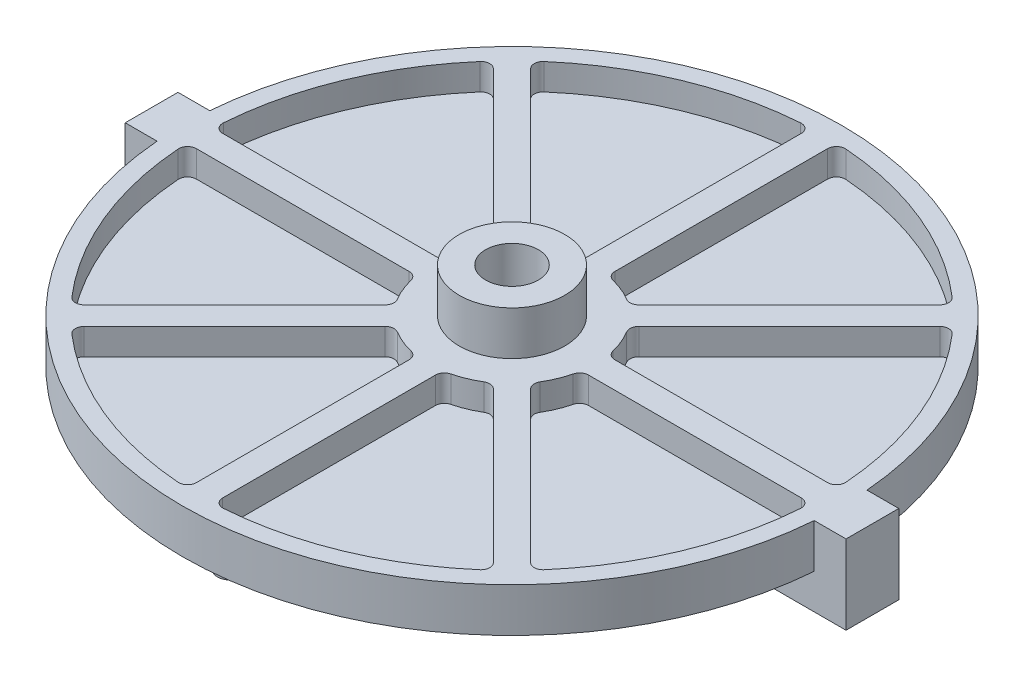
ISO-10303-21;
HEADER;
FILE_DESCRIPTION(('STEP AP214'),'2;1');
FILE_NAME('part.step','',(''),(''),'','','');
FILE_SCHEMA(('AUTOMOTIVE_DESIGN { 1 0 10303 214 1 1 1 1 }'));
ENDSEC;
DATA;
#1=APPLICATION_CONTEXT('core data for automotive mechanical design processes');
#2=APPLICATION_PROTOCOL_DEFINITION('international standard','automotive_design',2000,#1);
#3=PRODUCT_CONTEXT('',#1,'mechanical');
#4=PRODUCT('Part','Part','',(#3));
#5=PRODUCT_RELATED_PRODUCT_CATEGORY('part','',(#4));
#6=PRODUCT_DEFINITION_FORMATION('','',#4);
#7=PRODUCT_DEFINITION_CONTEXT('part definition',#1,'design');
#8=PRODUCT_DEFINITION('design','',#6,#7);
#9=PRODUCT_DEFINITION_SHAPE('','',#8);
#10=(LENGTH_UNIT() NAMED_UNIT(*) SI_UNIT(.MILLI.,.METRE.));
#11=(NAMED_UNIT(*) PLANE_ANGLE_UNIT() SI_UNIT($,.RADIAN.));
#12=(NAMED_UNIT(*) SI_UNIT($,.STERADIAN.) SOLID_ANGLE_UNIT());
#13=UNCERTAINTY_MEASURE_WITH_UNIT(LENGTH_MEASURE(1.E-05),#10,'distance_accuracy_value','');
#14=(GEOMETRIC_REPRESENTATION_CONTEXT(3) GLOBAL_UNCERTAINTY_ASSIGNED_CONTEXT((#13)) GLOBAL_UNIT_ASSIGNED_CONTEXT((#10,
#11,#12)) REPRESENTATION_CONTEXT('',''));
#15=CARTESIAN_POINT('',(0.,0.,0.));
#16=DIRECTION('',(0.,0.,1.));
#17=DIRECTION('',(1.,0.,0.));
#18=AXIS2_PLACEMENT_3D('',#15,#16,#17);
#19=CARTESIAN_POINT('',(0.,5.,0.));
#20=DIRECTION('',(0.,-1.,0.));
#21=DIRECTION('',(0.,0.,-1.));
#22=AXIS2_PLACEMENT_3D('',#19,#20,#21);
#23=CYLINDRICAL_SURFACE('',#22,37.5);
#24=DIRECTION('',(0.,-1.,0.));
#25=VECTOR('',#24,1.);
#26=CARTESIAN_POINT('',(-37.3798073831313,12.0075526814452,3.));
#27=LINE('',#26,#25);
#28=CARTESIAN_POINT('',(-37.3798073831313,5.,3.));
#29=VERTEX_POINT('',#28);
#30=CARTESIAN_POINT('',(-37.3798073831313,0.,3.));
#31=VERTEX_POINT('',#30);
#32=EDGE_CURVE('E550',#29,#31,#27,.T.);
#33=ORIENTED_EDGE('',*,*,#32,.T.);
#34=CARTESIAN_POINT('',(0.,0.,0.));
#35=DIRECTION('',(0.,1.,0.));
#36=DIRECTION('',(0.,0.,1.));
#37=AXIS2_PLACEMENT_3D('',#34,#35,#36);
#38=CIRCLE('',#37,37.5);
#39=CARTESIAN_POINT('',(37.3798073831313,0.,3.));
#40=VERTEX_POINT('',#39);
#41=EDGE_CURVE('E582',#31,#40,#38,.T.);
#42=ORIENTED_EDGE('',*,*,#41,.T.);
#43=DIRECTION('',(0.,-1.,0.));
#44=VECTOR('',#43,1.);
#45=CARTESIAN_POINT('',(37.3798073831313,12.0075526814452,3.));
#46=LINE('',#45,#44);
#47=CARTESIAN_POINT('',(37.3798073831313,5.,3.));
#48=VERTEX_POINT('',#47);
#49=EDGE_CURVE('E2275',#48,#40,#46,.T.);
#50=ORIENTED_EDGE('',*,*,#49,.F.);
#51=CARTESIAN_POINT('',(0.,5.,0.));
#52=DIRECTION('',(0.,1.,0.));
#53=DIRECTION('',(0.,0.,1.));
#54=AXIS2_PLACEMENT_3D('',#51,#52,#53);
#55=CIRCLE('',#54,37.5);
#56=EDGE_CURVE('E2096',#29,#48,#55,.T.);
#57=ORIENTED_EDGE('',*,*,#56,.F.);
#58=EDGE_LOOP('',(#33,#42,#50,#57));
#59=FACE_BOUND('',#58,.T.);
#60=ADVANCED_FACE('F41',(#59),#23,.T.);
#61=DIRECTION('',(0.,-1.,0.));
#62=VECTOR('',#61,1.);
#63=CARTESIAN_POINT('',(-37.3798073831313,12.0075526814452,-3.));
#64=LINE('',#63,#62);
#65=CARTESIAN_POINT('',(-37.3798073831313,5.,-3.));
#66=VERTEX_POINT('',#65);
#67=CARTESIAN_POINT('',(-37.3798073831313,0.,-3.));
#68=VERTEX_POINT('',#67);
#69=EDGE_CURVE('E556',#66,#68,#64,.T.);
#70=ORIENTED_EDGE('',*,*,#69,.F.);
#71=CARTESIAN_POINT('',(37.3798073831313,5.,-3.));
#72=VERTEX_POINT('',#71);
#73=EDGE_CURVE('E589',#72,#66,#55,.T.);
#74=ORIENTED_EDGE('',*,*,#73,.F.);
#75=DIRECTION('',(0.,-1.,0.));
#76=VECTOR('',#75,1.);
#77=CARTESIAN_POINT('',(37.3798073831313,12.0075526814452,-3.));
#78=LINE('',#77,#76);
#79=CARTESIAN_POINT('',(37.3798073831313,0.,-3.));
#80=VERTEX_POINT('',#79);
#81=EDGE_CURVE('E2262',#72,#80,#78,.T.);
#82=ORIENTED_EDGE('',*,*,#81,.T.);
#83=EDGE_CURVE('E587',#80,#68,#38,.T.);
#84=ORIENTED_EDGE('',*,*,#83,.T.);
#85=EDGE_LOOP('',(#70,#74,#82,#84));
#86=FACE_BOUND('',#85,.T.);
#87=ADVANCED_FACE('F1251',(#86),#23,.T.);
#88=CARTESIAN_POINT('',(0.,0.,0.));
#89=DIRECTION('',(0.,1.,0.));
#90=DIRECTION('',(0.,0.,1.));
#91=AXIS2_PLACEMENT_3D('',#88,#89,#90);
#92=PLANE('',#91);
#93=CARTESIAN_POINT('',(0.,0.,-17.));
#94=DIRECTION('',(0.,-1.,0.));
#95=DIRECTION('',(0.,0.,-1.));
#96=AXIS2_PLACEMENT_3D('',#93,#94,#95);
#97=CIRCLE('',#96,1.50000000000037);
#98=CARTESIAN_POINT('',(1.50000000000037,0.,-17.));
#99=VERTEX_POINT('',#98);
#100=CARTESIAN_POINT('',(-1.50000000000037,0.,-17.));
#101=VERTEX_POINT('',#100);
#102=EDGE_CURVE('E2184',#99,#101,#97,.T.);
#103=ORIENTED_EDGE('',*,*,#102,.F.);
#104=DIRECTION('',(0.,0.,1.));
#105=VECTOR('',#104,1.);
#106=CARTESIAN_POINT('',(1.50000000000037,0.,-17.));
#107=LINE('',#106,#105);
#108=CARTESIAN_POINT('',(1.50000000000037,0.,-32.));
#109=VERTEX_POINT('',#108);
#110=EDGE_CURVE('E2205',#109,#99,#107,.T.);
#111=ORIENTED_EDGE('',*,*,#110,.F.);
#112=CARTESIAN_POINT('',(0.,0.,-32.));
#113=DIRECTION('',(0.,-1.,0.));
#114=DIRECTION('',(0.,0.,-1.));
#115=AXIS2_PLACEMENT_3D('',#112,#113,#114);
#116=CIRCLE('',#115,1.50000000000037);
#117=CARTESIAN_POINT('',(-1.50000000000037,0.,-32.));
#118=VERTEX_POINT('',#117);
#119=EDGE_CURVE('E2209',#118,#109,#116,.T.);
#120=ORIENTED_EDGE('',*,*,#119,.F.);
#121=DIRECTION('',(0.,0.,-1.));
#122=VECTOR('',#121,1.);
#123=CARTESIAN_POINT('',(-1.50000000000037,0.,-17.));
#124=LINE('',#123,#122);
#125=EDGE_CURVE('E2188',#101,#118,#124,.T.);
#126=ORIENTED_EDGE('',*,*,#125,.F.);
#127=EDGE_LOOP('',(#103,#111,#120,#126));
#128=FACE_BOUND('',#127,.T.);
#129=DIRECTION('',(1.,0.,0.));
#130=VECTOR('',#129,1.);
#131=CARTESIAN_POINT('',(-41.,0.,-3.));
#132=LINE('',#131,#130);
#133=EDGE_CURVE('E2255',#68,#80,#132,.T.);
#134=ORIENTED_EDGE('',*,*,#133,.F.);
#135=ORIENTED_EDGE('',*,*,#83,.F.);
#136=EDGE_LOOP('',(#134,#135));
#137=FACE_BOUND('',#136,.T.);
#138=ADVANCED_FACE('F1257',(#128,#137),#92,.F.);
#139=DIRECTION('',(0.,0.,-1.));
#140=VECTOR('',#139,1.);
#141=CARTESIAN_POINT('',(1.50000000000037,0.,17.));
#142=LINE('',#141,#140);
#143=CARTESIAN_POINT('',(1.50000000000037,0.,32.));
#144=VERTEX_POINT('',#143);
#145=CARTESIAN_POINT('',(1.50000000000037,0.,17.));
#146=VERTEX_POINT('',#145);
#147=EDGE_CURVE('E2910',#144,#146,#142,.T.);
#148=ORIENTED_EDGE('',*,*,#147,.T.);
#149=CARTESIAN_POINT('',(0.,0.,17.));
#150=DIRECTION('',(0.,1.,0.));
#151=DIRECTION('',(0.,0.,1.));
#152=AXIS2_PLACEMENT_3D('',#149,#150,#151);
#153=CIRCLE('',#152,1.50000000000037);
#154=CARTESIAN_POINT('',(-1.50000000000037,0.,17.));
#155=VERTEX_POINT('',#154);
#156=EDGE_CURVE('E2345',#146,#155,#153,.T.);
#157=ORIENTED_EDGE('',*,*,#156,.T.);
#158=DIRECTION('',(0.,0.,1.));
#159=VECTOR('',#158,1.);
#160=CARTESIAN_POINT('',(-1.50000000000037,0.,17.));
#161=LINE('',#160,#159);
#162=CARTESIAN_POINT('',(-1.50000000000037,0.,32.));
#163=VERTEX_POINT('',#162);
#164=EDGE_CURVE('E2909',#155,#163,#161,.T.);
#165=ORIENTED_EDGE('',*,*,#164,.T.);
#166=CARTESIAN_POINT('',(0.,0.,32.));
#167=DIRECTION('',(0.,1.,0.));
#168=DIRECTION('',(0.,0.,1.));
#169=AXIS2_PLACEMENT_3D('',#166,#167,#168);
#170=CIRCLE('',#169,1.50000000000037);
#171=EDGE_CURVE('E2904',#163,#144,#170,.T.);
#172=ORIENTED_EDGE('',*,*,#171,.T.);
#173=EDGE_LOOP('',(#148,#157,#165,#172));
#174=FACE_BOUND('',#173,.T.);
#175=DIRECTION('',(-1.,0.,0.));
#176=VECTOR('',#175,1.);
#177=CARTESIAN_POINT('',(-41.,0.,3.));
#178=LINE('',#177,#176);
#179=EDGE_CURVE('E2285',#40,#31,#178,.T.);
#180=ORIENTED_EDGE('',*,*,#179,.F.);
#181=ORIENTED_EDGE('',*,*,#41,.F.);
#182=EDGE_LOOP('',(#180,#181));
#183=FACE_BOUND('',#182,.T.);
#184=ADVANCED_FACE('F1757',(#174,#183),#92,.F.);
#185=CARTESIAN_POINT('',(0.,2.,0.));
#186=DIRECTION('',(0.,1.,0.));
#187=DIRECTION('',(0.,0.,1.));
#188=AXIS2_PLACEMENT_3D('',#185,#186,#187);
#189=PLANE('',#188);
#190=DIRECTION('',(-1.,0.,0.));
#191=VECTOR('',#190,1.);
#192=CARTESIAN_POINT('',(0.,2.,-1.5));
#193=LINE('',#192,#191);
#194=CARTESIAN_POINT('',(34.4093010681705,2.,-1.5));
#195=VERTEX_POINT('',#194);
#196=CARTESIAN_POINT('',(10.1980390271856,2.,-1.5));
#197=VERTEX_POINT('',#196);
#198=EDGE_CURVE('E1238',#195,#197,#193,.T.);
#199=ORIENTED_EDGE('',*,*,#198,.F.);
#200=CARTESIAN_POINT('',(34.4093010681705,2.,-2.5));
#201=DIRECTION('',(0.,1.,0.));
#202=DIRECTION('',(0.,0.,1.));
#203=AXIS2_PLACEMENT_3D('',#200,#201,#202);
#204=CIRCLE('',#203,1.);
#205=CARTESIAN_POINT('',(35.4066721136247,2.,-2.57246376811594));
#206=VERTEX_POINT('',#205);
#207=EDGE_CURVE('E604',#195,#206,#204,.T.);
#208=ORIENTED_EDGE('',*,*,#207,.T.);
#209=CARTESIAN_POINT('',(0.,2.,0.));
#210=DIRECTION('',(0.,1.,0.));
#211=DIRECTION('',(0.,0.,1.));
#212=AXIS2_PLACEMENT_3D('',#209,#210,#211);
#213=CIRCLE('',#212,35.5);
#214=CARTESIAN_POINT('',(26.8553045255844,2.,-23.2172913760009));
#215=VERTEX_POINT('',#214);
#216=EDGE_CURVE('E1069',#206,#215,#213,.T.);
#217=ORIENTED_EDGE('',*,*,#216,.T.);
#218=CARTESIAN_POINT('',(26.0988170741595,2.,-22.5632831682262));
#219=DIRECTION('',(0.,1.,0.));
#220=DIRECTION('',(0.,0.,1.));
#221=AXIS2_PLACEMENT_3D('',#218,#219,#220);
#222=CIRCLE('',#221,1.);
#223=CARTESIAN_POINT('',(25.391710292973,2.,-23.2703899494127));
#224=VERTEX_POINT('',#223);
#225=EDGE_CURVE('E608',#215,#224,#222,.T.);
#226=ORIENTED_EDGE('',*,*,#225,.T.);
#227=DIRECTION('',(-0.707106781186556,0.,0.707106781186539));
#228=VECTOR('',#227,1.);
#229=CARTESIAN_POINT('',(1.06066017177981,2.,1.06066017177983));
#230=LINE('',#229,#228);
#231=CARTESIAN_POINT('',(8.27176272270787,2.,-6.15044237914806));
#232=VERTEX_POINT('',#231);
#233=EDGE_CURVE('E2168',#224,#232,#230,.T.);
#234=ORIENTED_EDGE('',*,*,#233,.T.);
#235=CARTESIAN_POINT('',(8.97886950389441,2.,-5.4433355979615));
#236=DIRECTION('',(0.,1.,0.));
#237=DIRECTION('',(0.,0.,1.));
#238=AXIS2_PLACEMENT_3D('',#235,#236,#237);
#239=CIRCLE('',#238,1.);
#240=CARTESIAN_POINT('',(8.12373907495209,2.,-4.92492268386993));
#241=VERTEX_POINT('',#240);
#242=EDGE_CURVE('E623',#232,#241,#239,.T.);
#243=ORIENTED_EDGE('',*,*,#242,.T.);
#244=CARTESIAN_POINT('',(0.,2.,0.));
#245=DIRECTION('',(0.,1.,0.));
#246=DIRECTION('',(0.,0.,1.));
#247=AXIS2_PLACEMENT_3D('',#244,#245,#246);
#248=CIRCLE('',#247,9.5);
#249=CARTESIAN_POINT('',(9.22679721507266,2.,-2.26190476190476));
#250=VERTEX_POINT('',#249);
#251=EDGE_CURVE('E1041',#250,#241,#248,.T.);
#252=ORIENTED_EDGE('',*,*,#251,.F.);
#253=CARTESIAN_POINT('',(10.1980390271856,2.,-2.5));
#254=DIRECTION('',(0.,1.,0.));
#255=DIRECTION('',(0.,0.,1.));
#256=AXIS2_PLACEMENT_3D('',#253,#254,#255);
#257=CIRCLE('',#256,1.);
#258=EDGE_CURVE('E625',#250,#197,#257,.T.);
#259=ORIENTED_EDGE('',*,*,#258,.T.);
#260=EDGE_LOOP('',(#199,#208,#217,#226,#234,#243,#252,#259));
#261=FACE_BOUND('',#260,.T.);
#262=ADVANCED_FACE('F1074',(#261),#189,.T.);
#263=CARTESIAN_POINT('',(0.,5.,0.));
#264=DIRECTION('',(0.,-1.,0.));
#265=DIRECTION('',(0.,0.,-1.));
#266=AXIS2_PLACEMENT_3D('',#263,#264,#265);
#267=CYLINDRICAL_SURFACE('',#266,35.5);
#268=ORIENTED_EDGE('',*,*,#216,.F.);
#269=DIRECTION('',(0.,-1.,0.));
#270=VECTOR('',#269,1.);
#271=CARTESIAN_POINT('',(35.4066721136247,5.,-2.57246376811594));
#272=LINE('',#271,#270);
#273=CARTESIAN_POINT('',(35.4066721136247,5.,-2.57246376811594));
#274=VERTEX_POINT('',#273);
#275=EDGE_CURVE('E1059',#206,#274,#272,.F.);
#276=ORIENTED_EDGE('',*,*,#275,.T.);
#277=CARTESIAN_POINT('',(0.,5.,0.));
#278=DIRECTION('',(0.,1.,0.));
#279=DIRECTION('',(0.,0.,1.));
#280=AXIS2_PLACEMENT_3D('',#277,#278,#279);
#281=CIRCLE('',#280,35.5);
#282=CARTESIAN_POINT('',(26.8553045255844,5.,-23.2172913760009));
#283=VERTEX_POINT('',#282);
#284=EDGE_CURVE('E588',#274,#283,#281,.T.);
#285=ORIENTED_EDGE('',*,*,#284,.T.);
#286=DIRECTION('',(0.,-1.,0.));
#287=VECTOR('',#286,1.);
#288=CARTESIAN_POINT('',(26.8553045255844,5.,-23.2172913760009));
#289=LINE('',#288,#287);
#290=EDGE_CURVE('E607',#283,#215,#289,.T.);
#291=ORIENTED_EDGE('',*,*,#290,.T.);
#292=EDGE_LOOP('',(#268,#276,#285,#291));
#293=FACE_BOUND('',#292,.T.);
#294=ADVANCED_FACE('F1068',(#293),#267,.F.);
#295=CARTESIAN_POINT('',(0.,31.8700576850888,0.));
#296=DIRECTION('',(0.,-1.,0.));
#297=DIRECTION('',(0.,0.,-1.));
#298=AXIS2_PLACEMENT_3D('',#295,#296,#297);
#299=CYLINDRICAL_SURFACE('',#298,9.5);
#300=ORIENTED_EDGE('',*,*,#251,.T.);
#301=DIRECTION('',(0.,-1.,0.));
#302=VECTOR('',#301,1.);
#303=CARTESIAN_POINT('',(8.12373907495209,31.8700576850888,-4.92492268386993));
#304=LINE('',#303,#302);
#305=CARTESIAN_POINT('',(8.12373907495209,5.,-4.92492268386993));
#306=VERTEX_POINT('',#305);
#307=EDGE_CURVE('E875',#241,#306,#304,.F.);
#308=ORIENTED_EDGE('',*,*,#307,.T.);
#309=CARTESIAN_POINT('',(0.,5.,0.));
#310=DIRECTION('',(0.,1.,0.));
#311=DIRECTION('',(0.,0.,1.));
#312=AXIS2_PLACEMENT_3D('',#309,#310,#311);
#313=CIRCLE('',#312,9.5);
#314=CARTESIAN_POINT('',(9.22679721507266,5.,-2.26190476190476));
#315=VERTEX_POINT('',#314);
#316=EDGE_CURVE('E799',#315,#306,#313,.T.);
#317=ORIENTED_EDGE('',*,*,#316,.F.);
#318=DIRECTION('',(0.,-1.,0.));
#319=VECTOR('',#318,1.);
#320=CARTESIAN_POINT('',(9.22679721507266,31.8700576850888,-2.26190476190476));
#321=LINE('',#320,#319);
#322=EDGE_CURVE('E870',#315,#250,#321,.T.);
#323=ORIENTED_EDGE('',*,*,#322,.T.);
#324=EDGE_LOOP('',(#300,#308,#317,#323));
#325=FACE_BOUND('',#324,.T.);
#326=ADVANCED_FACE('F1038',(#325),#299,.T.);
#327=DIRECTION('',(-0.707106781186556,0.,0.707106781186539));
#328=VECTOR('',#327,1.);
#329=CARTESIAN_POINT('',(-1.06066017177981,2.,-1.06066017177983));
#330=LINE('',#329,#328);
#331=CARTESIAN_POINT('',(23.2703899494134,2.,-25.3917102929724));
#332=VERTEX_POINT('',#331);
#333=CARTESIAN_POINT('',(6.15044237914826,2.,-8.27176272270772));
#334=VERTEX_POINT('',#333);
#335=EDGE_CURVE('E959',#332,#334,#330,.T.);
#336=ORIENTED_EDGE('',*,*,#335,.F.);
#337=CARTESIAN_POINT('',(22.5632831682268,2.,-26.098817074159));
#338=DIRECTION('',(0.,1.,0.));
#339=DIRECTION('',(0.,0.,1.));
#340=AXIS2_PLACEMENT_3D('',#337,#338,#339);
#341=CIRCLE('',#340,1.);
#342=CARTESIAN_POINT('',(23.2172913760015,2.,-26.8553045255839));
#343=VERTEX_POINT('',#342);
#344=EDGE_CURVE('E788',#332,#343,#341,.T.);
#345=ORIENTED_EDGE('',*,*,#344,.T.);
#346=CARTESIAN_POINT('',(2.57246376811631,2.,-35.4066721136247));
#347=VERTEX_POINT('',#346);
#348=EDGE_CURVE('E640',#343,#347,#213,.T.);
#349=ORIENTED_EDGE('',*,*,#348,.T.);
#350=CARTESIAN_POINT('',(2.50000000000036,2.,-34.4093010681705));
#351=DIRECTION('',(0.,1.,0.));
#352=DIRECTION('',(0.,0.,1.));
#353=AXIS2_PLACEMENT_3D('',#350,#351,#352);
#354=CIRCLE('',#353,1.);
#355=CARTESIAN_POINT('',(1.50000000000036,2.,-34.4093010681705));
#356=VERTEX_POINT('',#355);
#357=EDGE_CURVE('E884',#347,#356,#354,.T.);
#358=ORIENTED_EDGE('',*,*,#357,.T.);
#359=DIRECTION('',(0.,0.,1.));
#360=VECTOR('',#359,1.);
#361=CARTESIAN_POINT('',(1.5,2.,0.));
#362=LINE('',#361,#360);
#363=CARTESIAN_POINT('',(1.50000000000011,2.,-10.1980390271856));
#364=VERTEX_POINT('',#363);
#365=EDGE_CURVE('E2452',#356,#364,#362,.T.);
#366=ORIENTED_EDGE('',*,*,#365,.T.);
#367=CARTESIAN_POINT('',(2.50000000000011,2.,-10.1980390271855));
#368=DIRECTION('',(0.,1.,0.));
#369=DIRECTION('',(0.,0.,1.));
#370=AXIS2_PLACEMENT_3D('',#367,#368,#369);
#371=CIRCLE('',#370,1.);
#372=CARTESIAN_POINT('',(2.26190476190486,2.,-9.22679721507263));
#373=VERTEX_POINT('',#372);
#374=EDGE_CURVE('E886',#364,#373,#371,.T.);
#375=ORIENTED_EDGE('',*,*,#374,.T.);
#376=CARTESIAN_POINT('',(4.92492268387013,2.,-8.12373907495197));
#377=VERTEX_POINT('',#376);
#378=EDGE_CURVE('E803',#377,#373,#248,.T.);
#379=ORIENTED_EDGE('',*,*,#378,.F.);
#380=CARTESIAN_POINT('',(5.44333559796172,2.,-8.97886950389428));
#381=DIRECTION('',(0.,1.,0.));
#382=DIRECTION('',(0.,0.,1.));
#383=AXIS2_PLACEMENT_3D('',#380,#381,#382);
#384=CIRCLE('',#383,1.);
#385=EDGE_CURVE('E894',#377,#334,#384,.T.);
#386=ORIENTED_EDGE('',*,*,#385,.T.);
#387=EDGE_LOOP('',(#336,#345,#349,#358,#366,#375,#379,#386));
#388=FACE_BOUND('',#387,.T.);
#389=ADVANCED_FACE('F1511',(#388),#189,.T.);
#390=ORIENTED_EDGE('',*,*,#348,.F.);
#391=DIRECTION('',(0.,-1.,0.));
#392=VECTOR('',#391,1.);
#393=CARTESIAN_POINT('',(23.2172913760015,5.,-26.8553045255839));
#394=LINE('',#393,#392);
#395=CARTESIAN_POINT('',(23.2172913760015,5.,-26.8553045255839));
#396=VERTEX_POINT('',#395);
#397=EDGE_CURVE('E787',#343,#396,#394,.F.);
#398=ORIENTED_EDGE('',*,*,#397,.T.);
#399=CARTESIAN_POINT('',(2.57246376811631,5.,-35.4066721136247));
#400=VERTEX_POINT('',#399);
#401=EDGE_CURVE('E633',#396,#400,#281,.T.);
#402=ORIENTED_EDGE('',*,*,#401,.T.);
#403=DIRECTION('',(0.,-1.,0.));
#404=VECTOR('',#403,1.);
#405=CARTESIAN_POINT('',(2.57246376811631,5.,-35.4066721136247));
#406=LINE('',#405,#404);
#407=EDGE_CURVE('E782',#400,#347,#406,.T.);
#408=ORIENTED_EDGE('',*,*,#407,.T.);
#409=EDGE_LOOP('',(#390,#398,#402,#408));
#410=FACE_BOUND('',#409,.T.);
#411=ADVANCED_FACE('F1516',(#410),#267,.F.);
#412=ORIENTED_EDGE('',*,*,#378,.T.);
#413=DIRECTION('',(0.,-1.,0.));
#414=VECTOR('',#413,1.);
#415=CARTESIAN_POINT('',(2.26190476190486,31.8700576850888,-9.22679721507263));
#416=LINE('',#415,#414);
#417=CARTESIAN_POINT('',(2.26190476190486,5.,-9.22679721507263));
#418=VERTEX_POINT('',#417);
#419=EDGE_CURVE('E56',#373,#418,#416,.F.);
#420=ORIENTED_EDGE('',*,*,#419,.T.);
#421=CARTESIAN_POINT('',(4.92492268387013,5.,-8.12373907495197));
#422=VERTEX_POINT('',#421);
#423=EDGE_CURVE('E796',#422,#418,#313,.T.);
#424=ORIENTED_EDGE('',*,*,#423,.F.);
#425=DIRECTION('',(0.,-1.,0.));
#426=VECTOR('',#425,1.);
#427=CARTESIAN_POINT('',(4.92492268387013,31.8700576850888,-8.12373907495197));
#428=LINE('',#427,#426);
#429=EDGE_CURVE('E962',#422,#377,#428,.T.);
#430=ORIENTED_EDGE('',*,*,#429,.T.);
#431=EDGE_LOOP('',(#412,#420,#424,#430));
#432=FACE_BOUND('',#431,.T.);
#433=ADVANCED_FACE('F1542',(#432),#299,.T.);
#434=DIRECTION('',(0.,0.,1.));
#435=VECTOR('',#434,1.);
#436=CARTESIAN_POINT('',(-1.5,2.,0.));
#437=LINE('',#436,#435);
#438=CARTESIAN_POINT('',(-1.49999999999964,2.,-34.4093010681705));
#439=VERTEX_POINT('',#438);
#440=CARTESIAN_POINT('',(-1.49999999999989,2.,-10.1980390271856));
#441=VERTEX_POINT('',#440);
#442=EDGE_CURVE('E2447',#439,#441,#437,.T.);
#443=ORIENTED_EDGE('',*,*,#442,.F.);
#444=CARTESIAN_POINT('',(-2.49999999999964,2.,-34.4093010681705));
#445=DIRECTION('',(0.,1.,0.));
#446=DIRECTION('',(0.,0.,1.));
#447=AXIS2_PLACEMENT_3D('',#444,#445,#446);
#448=CIRCLE('',#447,1.);
#449=CARTESIAN_POINT('',(-2.57246376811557,2.,-35.4066721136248));
#450=VERTEX_POINT('',#449);
#451=EDGE_CURVE('E2462',#439,#450,#448,.T.);
#452=ORIENTED_EDGE('',*,*,#451,.T.);
#453=CARTESIAN_POINT('',(-23.217291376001,2.,-26.8553045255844));
#454=VERTEX_POINT('',#453);
#455=EDGE_CURVE('E1080',#450,#454,#213,.T.);
#456=ORIENTED_EDGE('',*,*,#455,.T.);
#457=CARTESIAN_POINT('',(-22.5632831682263,2.,-26.0988170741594));
#458=DIRECTION('',(0.,1.,0.));
#459=DIRECTION('',(0.,0.,1.));
#460=AXIS2_PLACEMENT_3D('',#457,#458,#459);
#461=CIRCLE('',#460,1.);
#462=CARTESIAN_POINT('',(-23.2703899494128,2.,-25.3917102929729));
#463=VERTEX_POINT('',#462);
#464=EDGE_CURVE('E2465',#454,#463,#461,.T.);
#465=ORIENTED_EDGE('',*,*,#464,.T.);
#466=DIRECTION('',(0.707106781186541,0.,0.707106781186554));
#467=VECTOR('',#466,1.);
#468=CARTESIAN_POINT('',(1.06066017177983,2.,-1.06066017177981));
#469=LINE('',#468,#467);
#470=CARTESIAN_POINT('',(-6.15044237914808,2.,-8.27176272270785));
#471=VERTEX_POINT('',#470);
#472=EDGE_CURVE('E2519',#463,#471,#469,.T.);
#473=ORIENTED_EDGE('',*,*,#472,.T.);
#474=CARTESIAN_POINT('',(-5.44333559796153,2.,-8.97886950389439));
#475=DIRECTION('',(0.,1.,0.));
#476=DIRECTION('',(0.,0.,1.));
#477=AXIS2_PLACEMENT_3D('',#474,#475,#476);
#478=CIRCLE('',#477,1.);
#479=CARTESIAN_POINT('',(-4.92492268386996,2.,-8.12373907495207));
#480=VERTEX_POINT('',#479);
#481=EDGE_CURVE('E2474',#471,#480,#478,.T.);
#482=ORIENTED_EDGE('',*,*,#481,.T.);
#483=CARTESIAN_POINT('',(-2.26190476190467,2.,-9.22679721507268));
#484=VERTEX_POINT('',#483);
#485=EDGE_CURVE('E2410',#484,#480,#248,.T.);
#486=ORIENTED_EDGE('',*,*,#485,.F.);
#487=CARTESIAN_POINT('',(-2.49999999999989,2.,-10.1980390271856));
#488=DIRECTION('',(0.,1.,0.));
#489=DIRECTION('',(0.,0.,1.));
#490=AXIS2_PLACEMENT_3D('',#487,#488,#489);
#491=CIRCLE('',#490,1.);
#492=EDGE_CURVE('E2476',#484,#441,#491,.T.);
#493=ORIENTED_EDGE('',*,*,#492,.T.);
#494=EDGE_LOOP('',(#443,#452,#456,#465,#473,#482,#486,#493));
#495=FACE_BOUND('',#494,.T.);
#496=ADVANCED_FACE('F1518',(#495),#189,.T.);
#497=ORIENTED_EDGE('',*,*,#455,.F.);
#498=DIRECTION('',(0.,-1.,0.));
#499=VECTOR('',#498,1.);
#500=CARTESIAN_POINT('',(-2.57246376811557,5.,-35.4066721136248));
#501=LINE('',#500,#499);
#502=CARTESIAN_POINT('',(-2.57246376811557,5.,-35.4066721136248));
#503=VERTEX_POINT('',#502);
#504=EDGE_CURVE('E2600',#450,#503,#501,.F.);
#505=ORIENTED_EDGE('',*,*,#504,.T.);
#506=CARTESIAN_POINT('',(-23.217291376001,5.,-26.8553045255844));
#507=VERTEX_POINT('',#506);
#508=EDGE_CURVE('E637',#503,#507,#281,.T.);
#509=ORIENTED_EDGE('',*,*,#508,.T.);
#510=DIRECTION('',(0.,-1.,0.));
#511=VECTOR('',#510,1.);
#512=CARTESIAN_POINT('',(-23.217291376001,5.,-26.8553045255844));
#513=LINE('',#512,#511);
#514=EDGE_CURVE('E2464',#507,#454,#513,.T.);
#515=ORIENTED_EDGE('',*,*,#514,.T.);
#516=EDGE_LOOP('',(#497,#505,#509,#515));
#517=FACE_BOUND('',#516,.T.);
#518=ADVANCED_FACE('F1544',(#517),#267,.F.);
#519=ORIENTED_EDGE('',*,*,#485,.T.);
#520=DIRECTION('',(0.,-1.,0.));
#521=VECTOR('',#520,1.);
#522=CARTESIAN_POINT('',(-4.92492268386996,31.8700576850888,-8.12373907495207));
#523=LINE('',#522,#521);
#524=CARTESIAN_POINT('',(-4.92492268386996,5.,-8.12373907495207));
#525=VERTEX_POINT('',#524);
#526=EDGE_CURVE('E2370',#480,#525,#523,.F.);
#527=ORIENTED_EDGE('',*,*,#526,.T.);
#528=CARTESIAN_POINT('',(-2.26190476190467,5.,-9.22679721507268));
#529=VERTEX_POINT('',#528);
#530=EDGE_CURVE('E800',#529,#525,#313,.T.);
#531=ORIENTED_EDGE('',*,*,#530,.F.);
#532=DIRECTION('',(0.,-1.,0.));
#533=VECTOR('',#532,1.);
#534=CARTESIAN_POINT('',(-2.26190476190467,31.8700576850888,-9.22679721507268));
#535=LINE('',#534,#533);
#536=EDGE_CURVE('E2365',#529,#484,#535,.T.);
#537=ORIENTED_EDGE('',*,*,#536,.T.);
#538=EDGE_LOOP('',(#519,#527,#531,#537));
#539=FACE_BOUND('',#538,.T.);
#540=ADVANCED_FACE('F1561',(#539),#299,.T.);
#541=DIRECTION('',(0.707106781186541,0.,0.707106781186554));
#542=VECTOR('',#541,1.);
#543=CARTESIAN_POINT('',(-1.06066017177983,2.,1.06066017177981));
#544=LINE('',#543,#542);
#545=CARTESIAN_POINT('',(-25.3917102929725,2.,-23.2703899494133));
#546=VERTEX_POINT('',#545);
#547=CARTESIAN_POINT('',(-8.27176272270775,2.,-6.15044237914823));
#548=VERTEX_POINT('',#547);
#549=EDGE_CURVE('E2518',#546,#548,#544,.T.);
#550=ORIENTED_EDGE('',*,*,#549,.F.);
#551=CARTESIAN_POINT('',(-26.0988170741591,2.,-22.5632831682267));
#552=DIRECTION('',(0.,1.,0.));
#553=DIRECTION('',(0.,0.,1.));
#554=AXIS2_PLACEMENT_3D('',#551,#552,#553);
#555=CIRCLE('',#554,1.);
#556=CARTESIAN_POINT('',(-26.8553045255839,2.,-23.2172913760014));
#557=VERTEX_POINT('',#556);
#558=EDGE_CURVE('E710',#546,#557,#555,.T.);
#559=ORIENTED_EDGE('',*,*,#558,.T.);
#560=CARTESIAN_POINT('',(-35.4066721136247,2.,-2.57246376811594));
#561=VERTEX_POINT('',#560);
#562=EDGE_CURVE('E1081',#557,#561,#213,.T.);
#563=ORIENTED_EDGE('',*,*,#562,.T.);
#564=CARTESIAN_POINT('',(-34.4093010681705,2.,-2.5));
#565=DIRECTION('',(0.,1.,0.));
#566=DIRECTION('',(0.,0.,1.));
#567=AXIS2_PLACEMENT_3D('',#564,#565,#566);
#568=CIRCLE('',#567,1.);
#569=CARTESIAN_POINT('',(-34.4093010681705,2.,-1.5));
#570=VERTEX_POINT('',#569);
#571=EDGE_CURVE('E2359',#561,#570,#568,.T.);
#572=ORIENTED_EDGE('',*,*,#571,.T.);
#573=DIRECTION('',(1.,0.,0.));
#574=VECTOR('',#573,1.);
#575=CARTESIAN_POINT('',(0.,2.,-1.5));
#576=LINE('',#575,#574);
#577=CARTESIAN_POINT('',(-10.1980390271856,2.,-1.5));
#578=VERTEX_POINT('',#577);
#579=EDGE_CURVE('E2613',#570,#578,#576,.T.);
#580=ORIENTED_EDGE('',*,*,#579,.T.);
#581=CARTESIAN_POINT('',(-10.1980390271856,2.,-2.5));
#582=DIRECTION('',(0.,1.,0.));
#583=DIRECTION('',(0.,0.,1.));
#584=AXIS2_PLACEMENT_3D('',#581,#582,#583);
#585=CIRCLE('',#584,1.);
#586=CARTESIAN_POINT('',(-9.22679721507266,2.,-2.26190476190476));
#587=VERTEX_POINT('',#586);
#588=EDGE_CURVE('E2355',#578,#587,#585,.T.);
#589=ORIENTED_EDGE('',*,*,#588,.T.);
#590=CARTESIAN_POINT('',(-8.12373907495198,2.,-4.9249226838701));
#591=VERTEX_POINT('',#590);
#592=EDGE_CURVE('E2494',#591,#587,#248,.T.);
#593=ORIENTED_EDGE('',*,*,#592,.F.);
#594=CARTESIAN_POINT('',(-8.9788695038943,2.,-5.44333559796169));
#595=DIRECTION('',(0.,1.,0.));
#596=DIRECTION('',(0.,0.,1.));
#597=AXIS2_PLACEMENT_3D('',#594,#595,#596);
#598=CIRCLE('',#597,1.);
#599=EDGE_CURVE('E2353',#591,#548,#598,.T.);
#600=ORIENTED_EDGE('',*,*,#599,.T.);
#601=EDGE_LOOP('',(#550,#559,#563,#572,#580,#589,#593,#600));
#602=FACE_BOUND('',#601,.T.);
#603=ADVANCED_FACE('F1434',(#602),#189,.T.);
#604=ORIENTED_EDGE('',*,*,#562,.F.);
#605=DIRECTION('',(0.,-1.,0.));
#606=VECTOR('',#605,1.);
#607=CARTESIAN_POINT('',(-26.855304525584,5.,-23.2172913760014));
#608=LINE('',#607,#606);
#609=CARTESIAN_POINT('',(-26.8553045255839,5.,-23.2172913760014));
#610=VERTEX_POINT('',#609);
#611=EDGE_CURVE('E709',#557,#610,#608,.F.);
#612=ORIENTED_EDGE('',*,*,#611,.T.);
#613=CARTESIAN_POINT('',(-35.4066721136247,5.,-2.57246376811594));
#614=VERTEX_POINT('',#613);
#615=EDGE_CURVE('E639',#610,#614,#281,.T.);
#616=ORIENTED_EDGE('',*,*,#615,.T.);
#617=DIRECTION('',(0.,-1.,0.));
#618=VECTOR('',#617,1.);
#619=CARTESIAN_POINT('',(-35.4066721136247,5.,-2.57246376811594));
#620=LINE('',#619,#618);
#621=EDGE_CURVE('E704',#614,#561,#620,.T.);
#622=ORIENTED_EDGE('',*,*,#621,.T.);
#623=EDGE_LOOP('',(#604,#612,#616,#622));
#624=FACE_BOUND('',#623,.T.);
#625=ADVANCED_FACE('F1485',(#624),#267,.F.);
#626=ORIENTED_EDGE('',*,*,#592,.T.);
#627=DIRECTION('',(0.,-1.,0.));
#628=VECTOR('',#627,1.);
#629=CARTESIAN_POINT('',(-9.22679721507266,31.8700576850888,-2.26190476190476));
#630=LINE('',#629,#628);
#631=CARTESIAN_POINT('',(-9.22679721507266,5.,-2.26190476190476));
#632=VERTEX_POINT('',#631);
#633=EDGE_CURVE('E728',#587,#632,#630,.F.);
#634=ORIENTED_EDGE('',*,*,#633,.T.);
#635=CARTESIAN_POINT('',(-8.12373907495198,5.,-4.9249226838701));
#636=VERTEX_POINT('',#635);
#637=EDGE_CURVE('E802',#636,#632,#313,.T.);
#638=ORIENTED_EDGE('',*,*,#637,.F.);
#639=DIRECTION('',(0.,-1.,0.));
#640=VECTOR('',#639,1.);
#641=CARTESIAN_POINT('',(-8.12373907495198,31.8700576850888,-4.9249226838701));
#642=LINE('',#641,#640);
#643=EDGE_CURVE('E723',#636,#591,#642,.T.);
#644=ORIENTED_EDGE('',*,*,#643,.T.);
#645=EDGE_LOOP('',(#626,#634,#638,#644));
#646=FACE_BOUND('',#645,.T.);
#647=ADVANCED_FACE('F1431',(#646),#299,.T.);
#648=DIRECTION('',(0.707106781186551,0.,-0.707106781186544));
#649=VECTOR('',#648,1.);
#650=CARTESIAN_POINT('',(-1.06066017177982,2.,-1.06066017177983));
#651=LINE('',#650,#649);
#652=CARTESIAN_POINT('',(-25.3917102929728,2.,23.2703899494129));
#653=VERTEX_POINT('',#652);
#654=CARTESIAN_POINT('',(-8.27176272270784,2.,6.15044237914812));
#655=VERTEX_POINT('',#654);
#656=EDGE_CURVE('E1172',#653,#655,#651,.T.);
#657=ORIENTED_EDGE('',*,*,#656,.T.);
#658=CARTESIAN_POINT('',(-8.97886950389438,2.,5.44333559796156));
#659=DIRECTION('',(0.,1.,0.));
#660=DIRECTION('',(0.,0.,1.));
#661=AXIS2_PLACEMENT_3D('',#658,#659,#660);
#662=CIRCLE('',#661,1.);
#663=CARTESIAN_POINT('',(-8.12373907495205,2.,4.92492268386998));
#664=VERTEX_POINT('',#663);
#665=EDGE_CURVE('E737',#655,#664,#662,.T.);
#666=ORIENTED_EDGE('',*,*,#665,.T.);
#667=CARTESIAN_POINT('',(-9.22679721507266,2.,2.26190476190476));
#668=VERTEX_POINT('',#667);
#669=EDGE_CURVE('E2520',#668,#664,#248,.T.);
#670=ORIENTED_EDGE('',*,*,#669,.F.);
#671=CARTESIAN_POINT('',(-10.1980390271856,2.,2.5));
#672=DIRECTION('',(0.,1.,0.));
#673=DIRECTION('',(0.,0.,1.));
#674=AXIS2_PLACEMENT_3D('',#671,#672,#673);
#675=CIRCLE('',#674,1.);
#676=CARTESIAN_POINT('',(-10.1980390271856,2.,1.5));
#677=VERTEX_POINT('',#676);
#678=EDGE_CURVE('E741',#668,#677,#675,.T.);
#679=ORIENTED_EDGE('',*,*,#678,.T.);
#680=DIRECTION('',(1.,0.,0.));
#681=VECTOR('',#680,1.);
#682=CARTESIAN_POINT('',(0.,2.,1.5));
#683=LINE('',#682,#681);
#684=CARTESIAN_POINT('',(-34.4093010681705,2.,1.5));
#685=VERTEX_POINT('',#684);
#686=EDGE_CURVE('E1030',#685,#677,#683,.T.);
#687=ORIENTED_EDGE('',*,*,#686,.F.);
#688=CARTESIAN_POINT('',(-34.4093010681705,2.,2.5));
#689=DIRECTION('',(0.,1.,0.));
#690=DIRECTION('',(0.,0.,1.));
#691=AXIS2_PLACEMENT_3D('',#688,#689,#690);
#692=CIRCLE('',#691,1.);
#693=CARTESIAN_POINT('',(-35.4066721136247,2.,2.57246376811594));
#694=VERTEX_POINT('',#693);
#695=EDGE_CURVE('E753',#685,#694,#692,.T.);
#696=ORIENTED_EDGE('',*,*,#695,.T.);
#697=CARTESIAN_POINT('',(-26.8553045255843,2.,23.2172913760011));
#698=VERTEX_POINT('',#697);
#699=EDGE_CURVE('E913',#694,#698,#213,.T.);
#700=ORIENTED_EDGE('',*,*,#699,.T.);
#701=CARTESIAN_POINT('',(-26.0988170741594,2.,22.5632831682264));
#702=DIRECTION('',(0.,1.,0.));
#703=DIRECTION('',(0.,0.,1.));
#704=AXIS2_PLACEMENT_3D('',#701,#702,#703);
#705=CIRCLE('',#704,1.);
#706=EDGE_CURVE('E755',#698,#653,#705,.T.);
#707=ORIENTED_EDGE('',*,*,#706,.T.);
#708=EDGE_LOOP('',(#657,#666,#670,#679,#687,#696,#700,#707));
#709=FACE_BOUND('',#708,.T.);
#710=ADVANCED_FACE('F1426',(#709),#189,.T.);
#711=ORIENTED_EDGE('',*,*,#699,.F.);
#712=DIRECTION('',(0.,-1.,0.));
#713=VECTOR('',#712,1.);
#714=CARTESIAN_POINT('',(-35.4066721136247,5.,2.57246376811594));
#715=LINE('',#714,#713);
#716=CARTESIAN_POINT('',(-35.4066721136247,5.,2.57246376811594));
#717=VERTEX_POINT('',#716);
#718=EDGE_CURVE('E769',#694,#717,#715,.F.);
#719=ORIENTED_EDGE('',*,*,#718,.T.);
#720=CARTESIAN_POINT('',(-26.8553045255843,5.,23.2172913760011));
#721=VERTEX_POINT('',#720);
#722=EDGE_CURVE('E638',#717,#721,#281,.T.);
#723=ORIENTED_EDGE('',*,*,#722,.T.);
#724=DIRECTION('',(0.,-1.,0.));
#725=VECTOR('',#724,1.);
#726=CARTESIAN_POINT('',(-26.8553045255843,5.,23.2172913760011));
#727=LINE('',#726,#725);
#728=EDGE_CURVE('E764',#721,#698,#727,.T.);
#729=ORIENTED_EDGE('',*,*,#728,.T.);
#730=EDGE_LOOP('',(#711,#719,#723,#729));
#731=FACE_BOUND('',#730,.T.);
#732=ADVANCED_FACE('F910',(#731),#267,.F.);
#733=ORIENTED_EDGE('',*,*,#669,.T.);
#734=DIRECTION('',(0.,-1.,0.));
#735=VECTOR('',#734,1.);
#736=CARTESIAN_POINT('',(-8.12373907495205,31.8700576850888,4.92492268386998));
#737=LINE('',#736,#735);
#738=CARTESIAN_POINT('',(-8.12373907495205,5.,4.92492268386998));
#739=VERTEX_POINT('',#738);
#740=EDGE_CURVE('E2625',#664,#739,#737,.F.);
#741=ORIENTED_EDGE('',*,*,#740,.T.);
#742=CARTESIAN_POINT('',(-9.22679721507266,5.,2.26190476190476));
#743=VERTEX_POINT('',#742);
#744=EDGE_CURVE('E801',#743,#739,#313,.T.);
#745=ORIENTED_EDGE('',*,*,#744,.F.);
#746=DIRECTION('',(0.,-1.,0.));
#747=VECTOR('',#746,1.);
#748=CARTESIAN_POINT('',(-9.22679721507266,31.8700576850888,2.26190476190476));
#749=LINE('',#748,#747);
#750=EDGE_CURVE('E740',#743,#668,#749,.T.);
#751=ORIENTED_EDGE('',*,*,#750,.T.);
#752=EDGE_LOOP('',(#733,#741,#745,#751));
#753=FACE_BOUND('',#752,.T.);
#754=ADVANCED_FACE('F1456',(#753),#299,.T.);
#755=CARTESIAN_POINT('',(-23.2172913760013,2.,26.855304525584));
#756=VERTEX_POINT('',#755);
#757=CARTESIAN_POINT('',(-2.57246376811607,2.,35.4066721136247));
#758=VERTEX_POINT('',#757);
#759=EDGE_CURVE('E1076',#756,#758,#213,.T.);
#760=ORIENTED_EDGE('',*,*,#759,.T.);
#761=CARTESIAN_POINT('',(-2.50000000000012,2.,34.4093010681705));
#762=DIRECTION('',(0.,1.,0.));
#763=DIRECTION('',(0.,0.,1.));
#764=AXIS2_PLACEMENT_3D('',#761,#762,#763);
#765=CIRCLE('',#764,1.);
#766=CARTESIAN_POINT('',(-1.50000000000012,2.,34.4093010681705));
#767=VERTEX_POINT('',#766);
#768=EDGE_CURVE('E1182',#758,#767,#765,.T.);
#769=ORIENTED_EDGE('',*,*,#768,.T.);
#770=DIRECTION('',(0.,0.,-1.));
#771=VECTOR('',#770,1.);
#772=CARTESIAN_POINT('',(-1.5,2.,0.));
#773=LINE('',#772,#771);
#774=CARTESIAN_POINT('',(-1.50000000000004,2.,10.1980390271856));
#775=VERTEX_POINT('',#774);
#776=EDGE_CURVE('E1151',#767,#775,#773,.T.);
#777=ORIENTED_EDGE('',*,*,#776,.T.);
#778=CARTESIAN_POINT('',(-2.50000000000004,2.,10.1980390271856));
#779=DIRECTION('',(0.,1.,0.));
#780=DIRECTION('',(0.,0.,1.));
#781=AXIS2_PLACEMENT_3D('',#778,#779,#780);
#782=CIRCLE('',#781,1.);
#783=CARTESIAN_POINT('',(-2.26190476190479,2.,9.22679721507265));
#784=VERTEX_POINT('',#783);
#785=EDGE_CURVE('E1186',#775,#784,#782,.T.);
#786=ORIENTED_EDGE('',*,*,#785,.T.);
#787=CARTESIAN_POINT('',(-4.92492268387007,2.,8.123739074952));
#788=VERTEX_POINT('',#787);
#789=EDGE_CURVE('E2523',#788,#784,#248,.T.);
#790=ORIENTED_EDGE('',*,*,#789,.F.);
#791=CARTESIAN_POINT('',(-5.44333559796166,2.,8.97886950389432));
#792=DIRECTION('',(0.,1.,0.));
#793=DIRECTION('',(0.,0.,1.));
#794=AXIS2_PLACEMENT_3D('',#791,#792,#793);
#795=CIRCLE('',#794,1.);
#796=CARTESIAN_POINT('',(-6.1504423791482,2.,8.27176272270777));
#797=VERTEX_POINT('',#796);
#798=EDGE_CURVE('E1196',#788,#797,#795,.T.);
#799=ORIENTED_EDGE('',*,*,#798,.T.);
#800=DIRECTION('',(0.707106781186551,0.,-0.707106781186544));
#801=VECTOR('',#800,1.);
#802=CARTESIAN_POINT('',(1.06066017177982,2.,1.06066017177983));
#803=LINE('',#802,#801);
#804=CARTESIAN_POINT('',(-23.2703899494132,2.,25.3917102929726));
#805=VERTEX_POINT('',#804);
#806=EDGE_CURVE('E1167',#805,#797,#803,.T.);
#807=ORIENTED_EDGE('',*,*,#806,.F.);
#808=CARTESIAN_POINT('',(-22.5632831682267,2.,26.0988170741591));
#809=DIRECTION('',(0.,1.,0.));
#810=DIRECTION('',(0.,0.,1.));
#811=AXIS2_PLACEMENT_3D('',#808,#809,#810);
#812=CIRCLE('',#811,1.);
#813=EDGE_CURVE('E1198',#805,#756,#812,.T.);
#814=ORIENTED_EDGE('',*,*,#813,.T.);
#815=EDGE_LOOP('',(#760,#769,#777,#786,#790,#799,#807,#814));
#816=FACE_BOUND('',#815,.T.);
#817=ADVANCED_FACE('F1433',(#816),#189,.T.);
#818=CARTESIAN_POINT('',(-23.2172913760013,5.,26.855304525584));
#819=VERTEX_POINT('',#818);
#820=CARTESIAN_POINT('',(-2.57246376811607,5.,35.4066721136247));
#821=VERTEX_POINT('',#820);
#822=EDGE_CURVE('E926',#819,#821,#281,.T.);
#823=ORIENTED_EDGE('',*,*,#822,.T.);
#824=DIRECTION('',(0.,-1.,0.));
#825=VECTOR('',#824,1.);
#826=CARTESIAN_POINT('',(-2.57246376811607,5.,35.4066721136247));
#827=LINE('',#826,#825);
#828=EDGE_CURVE('E1202',#821,#758,#827,.T.);
#829=ORIENTED_EDGE('',*,*,#828,.T.);
#830=ORIENTED_EDGE('',*,*,#759,.F.);
#831=DIRECTION('',(0.,-1.,0.));
#832=VECTOR('',#831,1.);
#833=CARTESIAN_POINT('',(-23.2172913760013,5.,26.855304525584));
#834=LINE('',#833,#832);
#835=EDGE_CURVE('E1207',#756,#819,#834,.F.);
#836=ORIENTED_EDGE('',*,*,#835,.T.);
#837=EDGE_LOOP('',(#823,#829,#830,#836));
#838=FACE_BOUND('',#837,.T.);
#839=ADVANCED_FACE('F1484',(#838),#267,.F.);
#840=ORIENTED_EDGE('',*,*,#789,.T.);
#841=DIRECTION('',(0.,-1.,0.));
#842=VECTOR('',#841,1.);
#843=CARTESIAN_POINT('',(-2.26190476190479,31.8700576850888,9.22679721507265));
#844=LINE('',#843,#842);
#845=CARTESIAN_POINT('',(-2.26190476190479,5.,9.22679721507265));
#846=VERTEX_POINT('',#845);
#847=EDGE_CURVE('E1222',#784,#846,#844,.F.);
#848=ORIENTED_EDGE('',*,*,#847,.T.);
#849=CARTESIAN_POINT('',(-4.92492268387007,5.,8.123739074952));
#850=VERTEX_POINT('',#849);
#851=EDGE_CURVE('E1051',#850,#846,#313,.T.);
#852=ORIENTED_EDGE('',*,*,#851,.F.);
#853=DIRECTION('',(0.,-1.,0.));
#854=VECTOR('',#853,1.);
#855=CARTESIAN_POINT('',(-4.92492268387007,31.8700576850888,8.123739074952));
#856=LINE('',#855,#854);
#857=EDGE_CURVE('E1218',#850,#788,#856,.T.);
#858=ORIENTED_EDGE('',*,*,#857,.T.);
#859=EDGE_LOOP('',(#840,#848,#852,#858));
#860=FACE_BOUND('',#859,.T.);
#861=ADVANCED_FACE('F1463',(#860),#299,.T.);
#862=CARTESIAN_POINT('',(2.57246376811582,2.,35.4066721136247));
#863=VERTEX_POINT('',#862);
#864=CARTESIAN_POINT('',(23.2172913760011,2.,26.8553045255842));
#865=VERTEX_POINT('',#864);
#866=EDGE_CURVE('E1083',#863,#865,#213,.T.);
#867=ORIENTED_EDGE('',*,*,#866,.T.);
#868=CARTESIAN_POINT('',(22.5632831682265,2.,26.0988170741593));
#869=DIRECTION('',(0.,1.,0.));
#870=DIRECTION('',(0.,0.,1.));
#871=AXIS2_PLACEMENT_3D('',#868,#869,#870);
#872=CIRCLE('',#871,1.);
#873=CARTESIAN_POINT('',(23.270389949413,2.,25.3917102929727));
#874=VERTEX_POINT('',#873);
#875=EDGE_CURVE('E1099',#865,#874,#872,.T.);
#876=ORIENTED_EDGE('',*,*,#875,.T.);
#877=DIRECTION('',(-0.707106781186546,0.,-0.707106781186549));
#878=VECTOR('',#877,1.);
#879=CARTESIAN_POINT('',(-1.06066017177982,2.,1.06066017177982));
#880=LINE('',#879,#878);
#881=CARTESIAN_POINT('',(6.15044237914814,2.,8.27176272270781));
#882=VERTEX_POINT('',#881);
#883=EDGE_CURVE('E2422',#874,#882,#880,.T.);
#884=ORIENTED_EDGE('',*,*,#883,.T.);
#885=CARTESIAN_POINT('',(5.44333559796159,2.,8.97886950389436));
#886=DIRECTION('',(0.,1.,0.));
#887=DIRECTION('',(0.,0.,1.));
#888=AXIS2_PLACEMENT_3D('',#885,#886,#887);
#889=CIRCLE('',#888,1.);
#890=CARTESIAN_POINT('',(4.92492268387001,2.,8.12373907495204));
#891=VERTEX_POINT('',#890);
#892=EDGE_CURVE('E1137',#882,#891,#889,.T.);
#893=ORIENTED_EDGE('',*,*,#892,.T.);
#894=CARTESIAN_POINT('',(2.26190476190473,2.,9.22679721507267));
#895=VERTEX_POINT('',#894);
#896=EDGE_CURVE('E2408',#895,#891,#248,.T.);
#897=ORIENTED_EDGE('',*,*,#896,.F.);
#898=CARTESIAN_POINT('',(2.49999999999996,2.,10.1980390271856));
#899=DIRECTION('',(0.,1.,0.));
#900=DIRECTION('',(0.,0.,1.));
#901=AXIS2_PLACEMENT_3D('',#898,#899,#900);
#902=CIRCLE('',#901,1.);
#903=CARTESIAN_POINT('',(1.49999999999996,2.,10.1980390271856));
#904=VERTEX_POINT('',#903);
#905=EDGE_CURVE('E1127',#895,#904,#902,.T.);
#906=ORIENTED_EDGE('',*,*,#905,.T.);
#907=DIRECTION('',(0.,0.,-1.));
#908=VECTOR('',#907,1.);
#909=CARTESIAN_POINT('',(1.5,2.,0.));
#910=LINE('',#909,#908);
#911=CARTESIAN_POINT('',(1.49999999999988,2.,34.4093010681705));
#912=VERTEX_POINT('',#911);
#913=EDGE_CURVE('E1145',#912,#904,#910,.T.);
#914=ORIENTED_EDGE('',*,*,#913,.F.);
#915=CARTESIAN_POINT('',(2.49999999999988,2.,34.4093010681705));
#916=DIRECTION('',(0.,1.,0.));
#917=DIRECTION('',(0.,0.,1.));
#918=AXIS2_PLACEMENT_3D('',#915,#916,#917);
#919=CIRCLE('',#918,1.);
#920=EDGE_CURVE('E1102',#912,#863,#919,.T.);
#921=ORIENTED_EDGE('',*,*,#920,.T.);
#922=EDGE_LOOP('',(#867,#876,#884,#893,#897,#906,#914,#921));
#923=FACE_BOUND('',#922,.T.);
#924=ADVANCED_FACE('F1097',(#923),#189,.T.);
#925=CARTESIAN_POINT('',(2.57246376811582,5.,35.4066721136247));
#926=VERTEX_POINT('',#925);
#927=CARTESIAN_POINT('',(23.2172913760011,5.,26.8553045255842));
#928=VERTEX_POINT('',#927);
#929=EDGE_CURVE('E1078',#926,#928,#281,.T.);
#930=ORIENTED_EDGE('',*,*,#929,.T.);
#931=DIRECTION('',(0.,-1.,0.));
#932=VECTOR('',#931,1.);
#933=CARTESIAN_POINT('',(23.2172913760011,5.,26.8553045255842));
#934=LINE('',#933,#932);
#935=EDGE_CURVE('E1111',#928,#865,#934,.T.);
#936=ORIENTED_EDGE('',*,*,#935,.T.);
#937=ORIENTED_EDGE('',*,*,#866,.F.);
#938=DIRECTION('',(0.,-1.,0.));
#939=VECTOR('',#938,1.);
#940=CARTESIAN_POINT('',(2.57246376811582,5.,35.4066721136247));
#941=LINE('',#940,#939);
#942=EDGE_CURVE('E1108',#863,#926,#941,.F.);
#943=ORIENTED_EDGE('',*,*,#942,.T.);
#944=EDGE_LOOP('',(#930,#936,#937,#943));
#945=FACE_BOUND('',#944,.T.);
#946=ADVANCED_FACE('F1107',(#945),#267,.F.);
#947=ORIENTED_EDGE('',*,*,#896,.T.);
#948=DIRECTION('',(0.,-1.,0.));
#949=VECTOR('',#948,1.);
#950=CARTESIAN_POINT('',(4.92492268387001,31.8700576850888,8.12373907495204));
#951=LINE('',#950,#949);
#952=CARTESIAN_POINT('',(4.92492268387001,5.,8.12373907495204));
#953=VERTEX_POINT('',#952);
#954=EDGE_CURVE('E863',#891,#953,#951,.F.);
#955=ORIENTED_EDGE('',*,*,#954,.T.);
#956=CARTESIAN_POINT('',(2.26190476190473,5.,9.22679721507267));
#957=VERTEX_POINT('',#956);
#958=EDGE_CURVE('E2526',#957,#953,#313,.T.);
#959=ORIENTED_EDGE('',*,*,#958,.F.);
#960=DIRECTION('',(0.,-1.,0.));
#961=VECTOR('',#960,1.);
#962=CARTESIAN_POINT('',(2.26190476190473,31.8700576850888,9.22679721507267));
#963=LINE('',#962,#961);
#964=EDGE_CURVE('E858',#957,#895,#963,.T.);
#965=ORIENTED_EDGE('',*,*,#964,.T.);
#966=EDGE_LOOP('',(#947,#955,#959,#965));
#967=FACE_BOUND('',#966,.T.);
#968=ADVANCED_FACE('F1647',(#967),#299,.T.);
#969=CARTESIAN_POINT('',(26.8553045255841,2.,23.2172913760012));
#970=VERTEX_POINT('',#969);
#971=CARTESIAN_POINT('',(35.4066721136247,2.,2.57246376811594));
#972=VERTEX_POINT('',#971);
#973=EDGE_CURVE('E1050',#970,#972,#213,.T.);
#974=ORIENTED_EDGE('',*,*,#973,.T.);
#975=CARTESIAN_POINT('',(34.4093010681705,2.,2.5));
#976=DIRECTION('',(0.,1.,0.));
#977=DIRECTION('',(0.,0.,1.));
#978=AXIS2_PLACEMENT_3D('',#975,#976,#977);
#979=CIRCLE('',#978,1.);
#980=CARTESIAN_POINT('',(34.4093010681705,2.,1.5));
#981=VERTEX_POINT('',#980);
#982=EDGE_CURVE('E2140',#972,#981,#979,.T.);
#983=ORIENTED_EDGE('',*,*,#982,.T.);
#984=DIRECTION('',(-1.,0.,0.));
#985=VECTOR('',#984,1.);
#986=CARTESIAN_POINT('',(0.,2.,1.5));
#987=LINE('',#986,#985);
#988=CARTESIAN_POINT('',(10.1980390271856,2.,1.5));
#989=VERTEX_POINT('',#988);
#990=EDGE_CURVE('E1243',#981,#989,#987,.T.);
#991=ORIENTED_EDGE('',*,*,#990,.T.);
#992=CARTESIAN_POINT('',(10.1980390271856,2.,2.5));
#993=DIRECTION('',(0.,1.,0.));
#994=DIRECTION('',(0.,0.,1.));
#995=AXIS2_PLACEMENT_3D('',#992,#993,#994);
#996=CIRCLE('',#995,1.);
#997=CARTESIAN_POINT('',(9.22679721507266,2.,2.26190476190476));
#998=VERTEX_POINT('',#997);
#999=EDGE_CURVE('E2391',#989,#998,#996,.T.);
#1000=ORIENTED_EDGE('',*,*,#999,.T.);
#1001=CARTESIAN_POINT('',(8.12373907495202,2.,4.92492268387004));
#1002=VERTEX_POINT('',#1001);
#1003=EDGE_CURVE('E2403',#1002,#998,#248,.T.);
#1004=ORIENTED_EDGE('',*,*,#1003,.F.);
#1005=CARTESIAN_POINT('',(8.97886950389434,2.,5.44333559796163));
#1006=DIRECTION('',(0.,1.,0.));
#1007=DIRECTION('',(0.,0.,1.));
#1008=AXIS2_PLACEMENT_3D('',#1005,#1006,#1007);
#1009=CIRCLE('',#1008,1.);
#1010=CARTESIAN_POINT('',(8.27176272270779,2.,6.15044237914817));
#1011=VERTEX_POINT('',#1010);
#1012=EDGE_CURVE('E2389',#1002,#1011,#1009,.T.);
#1013=ORIENTED_EDGE('',*,*,#1012,.T.);
#1014=DIRECTION('',(-0.707106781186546,0.,-0.707106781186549));
#1015=VECTOR('',#1014,1.);
#1016=CARTESIAN_POINT('',(1.06066017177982,2.,-1.06066017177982));
#1017=LINE('',#1016,#1015);
#1018=CARTESIAN_POINT('',(25.3917102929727,2.,23.2703899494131));
#1019=VERTEX_POINT('',#1018);
#1020=EDGE_CURVE('E2417',#1019,#1011,#1017,.T.);
#1021=ORIENTED_EDGE('',*,*,#1020,.F.);
#1022=CARTESIAN_POINT('',(26.0988170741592,2.,22.5632831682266));
#1023=DIRECTION('',(0.,1.,0.));
#1024=DIRECTION('',(0.,0.,1.));
#1025=AXIS2_PLACEMENT_3D('',#1022,#1023,#1024);
#1026=CIRCLE('',#1025,1.);
#1027=EDGE_CURVE('E2381',#1019,#970,#1026,.T.);
#1028=ORIENTED_EDGE('',*,*,#1027,.T.);
#1029=EDGE_LOOP('',(#974,#983,#991,#1000,#1004,#1013,#1021,#1028));
#1030=FACE_BOUND('',#1029,.T.);
#1031=ADVANCED_FACE('F1637',(#1030),#189,.T.);
#1032=CARTESIAN_POINT('',(0.,5.,0.));
#1033=DIRECTION('',(0.,1.,0.));
#1034=DIRECTION('',(0.,0.,1.));
#1035=AXIS2_PLACEMENT_3D('',#1032,#1033,#1034);
#1036=PLANE('',#1035);
#1037=DIRECTION('',(-0.707106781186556,0.,0.707106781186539));
#1038=VECTOR('',#1037,1.);
#1039=CARTESIAN_POINT('',(-1.06066017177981,5.,-1.06066017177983));
#1040=LINE('',#1039,#1038);
#1041=CARTESIAN_POINT('',(6.15044237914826,5.,-8.27176272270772));
#1042=VERTEX_POINT('',#1041);
#1043=CARTESIAN_POINT('',(23.2703899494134,5.,-25.3917102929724));
#1044=VERTEX_POINT('',#1043);
#1045=EDGE_CURVE('E2166',#1042,#1044,#1040,.F.);
#1046=ORIENTED_EDGE('',*,*,#1045,.F.);
#1047=CARTESIAN_POINT('',(5.44333559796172,5.,-8.97886950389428));
#1048=DIRECTION('',(0.,1.,0.));
#1049=DIRECTION('',(0.,0.,1.));
#1050=AXIS2_PLACEMENT_3D('',#1047,#1048,#1049);
#1051=CIRCLE('',#1050,1.);
#1052=EDGE_CURVE('E49',#1042,#422,#1051,.F.);
#1053=ORIENTED_EDGE('',*,*,#1052,.T.);
#1054=ORIENTED_EDGE('',*,*,#423,.T.);
#1055=CARTESIAN_POINT('',(2.50000000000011,5.,-10.1980390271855));
#1056=DIRECTION('',(0.,1.,0.));
#1057=DIRECTION('',(0.,0.,1.));
#1058=AXIS2_PLACEMENT_3D('',#1055,#1056,#1057);
#1059=CIRCLE('',#1058,1.);
#1060=CARTESIAN_POINT('',(1.50000000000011,5.,-10.1980390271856));
#1061=VERTEX_POINT('',#1060);
#1062=EDGE_CURVE('E942',#418,#1061,#1059,.F.);
#1063=ORIENTED_EDGE('',*,*,#1062,.T.);
#1064=DIRECTION('',(0.,0.,1.));
#1065=VECTOR('',#1064,1.);
#1066=CARTESIAN_POINT('',(1.5,5.,0.));
#1067=LINE('',#1066,#1065);
#1068=CARTESIAN_POINT('',(1.50000000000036,5.,-34.4093010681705));
#1069=VERTEX_POINT('',#1068);
#1070=EDGE_CURVE('E946',#1061,#1069,#1067,.F.);
#1071=ORIENTED_EDGE('',*,*,#1070,.T.);
#1072=CARTESIAN_POINT('',(2.50000000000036,5.,-34.4093010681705));
#1073=DIRECTION('',(0.,1.,0.));
#1074=DIRECTION('',(0.,0.,1.));
#1075=AXIS2_PLACEMENT_3D('',#1072,#1073,#1074);
#1076=CIRCLE('',#1075,1.);
#1077=EDGE_CURVE('E940',#1069,#400,#1076,.F.);
#1078=ORIENTED_EDGE('',*,*,#1077,.T.);
#1079=ORIENTED_EDGE('',*,*,#401,.F.);
#1080=CARTESIAN_POINT('',(22.5632831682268,5.,-26.098817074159));
#1081=DIRECTION('',(0.,1.,0.));
#1082=DIRECTION('',(0.,0.,1.));
#1083=AXIS2_PLACEMENT_3D('',#1080,#1081,#1082);
#1084=CIRCLE('',#1083,1.);
#1085=EDGE_CURVE('E933',#396,#1044,#1084,.F.);
#1086=ORIENTED_EDGE('',*,*,#1085,.T.);
#1087=EDGE_LOOP('',(#1046,#1053,#1054,#1063,#1071,#1078,#1079,#1086));
#1088=FACE_BOUND('',#1087,.T.);
#1089=ORIENTED_EDGE('',*,*,#744,.T.);
#1090=CARTESIAN_POINT('',(-8.97886950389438,5.,5.44333559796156));
#1091=DIRECTION('',(0.,1.,0.));
#1092=DIRECTION('',(0.,0.,1.));
#1093=AXIS2_PLACEMENT_3D('',#1090,#1091,#1092);
#1094=CIRCLE('',#1093,1.);
#1095=CARTESIAN_POINT('',(-8.27176272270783,5.,6.15044237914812));
#1096=VERTEX_POINT('',#1095);
#1097=EDGE_CURVE('E935',#739,#1096,#1094,.F.);
#1098=ORIENTED_EDGE('',*,*,#1097,.T.);
#1099=DIRECTION('',(0.707106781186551,0.,-0.707106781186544));
#1100=VECTOR('',#1099,1.);
#1101=CARTESIAN_POINT('',(-1.06066017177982,5.,-1.06066017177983));
#1102=LINE('',#1101,#1100);
#1103=CARTESIAN_POINT('',(-25.3917102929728,5.,23.2703899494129));
#1104=VERTEX_POINT('',#1103);
#1105=EDGE_CURVE('E1016',#1096,#1104,#1102,.F.);
#1106=ORIENTED_EDGE('',*,*,#1105,.T.);
#1107=CARTESIAN_POINT('',(-26.0988170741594,5.,22.5632831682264));
#1108=DIRECTION('',(0.,1.,0.));
#1109=DIRECTION('',(0.,0.,1.));
#1110=AXIS2_PLACEMENT_3D('',#1107,#1108,#1109);
#1111=CIRCLE('',#1110,1.);
#1112=EDGE_CURVE('E925',#1104,#721,#1111,.F.);
#1113=ORIENTED_EDGE('',*,*,#1112,.T.);
#1114=ORIENTED_EDGE('',*,*,#722,.F.);
#1115=CARTESIAN_POINT('',(-34.4093010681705,5.,2.5));
#1116=DIRECTION('',(0.,1.,0.));
#1117=DIRECTION('',(0.,0.,1.));
#1118=AXIS2_PLACEMENT_3D('',#1115,#1116,#1117);
#1119=CIRCLE('',#1118,1.);
#1120=CARTESIAN_POINT('',(-34.4093010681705,5.,1.5));
#1121=VERTEX_POINT('',#1120);
#1122=EDGE_CURVE('E921',#717,#1121,#1119,.F.);
#1123=ORIENTED_EDGE('',*,*,#1122,.T.);
#1124=DIRECTION('',(1.,0.,0.));
#1125=VECTOR('',#1124,1.);
#1126=CARTESIAN_POINT('',(0.,5.,1.5));
#1127=LINE('',#1126,#1125);
#1128=CARTESIAN_POINT('',(-10.1980390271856,5.,1.5));
#1129=VERTEX_POINT('',#1128);
#1130=EDGE_CURVE('E2616',#1129,#1121,#1127,.F.);
#1131=ORIENTED_EDGE('',*,*,#1130,.F.);
#1132=CARTESIAN_POINT('',(-10.1980390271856,5.,2.5));
#1133=DIRECTION('',(0.,1.,0.));
#1134=DIRECTION('',(0.,0.,1.));
#1135=AXIS2_PLACEMENT_3D('',#1132,#1133,#1134);
#1136=CIRCLE('',#1135,1.);
#1137=EDGE_CURVE('E931',#1129,#743,#1136,.F.);
#1138=ORIENTED_EDGE('',*,*,#1137,.T.);
#1139=EDGE_LOOP('',(#1089,#1098,#1106,#1113,#1114,#1123,#1131,#1138));
#1140=FACE_BOUND('',#1139,.T.);
#1141=CARTESIAN_POINT('',(0.,5.,0.));
#1142=DIRECTION('',(0.,1.,0.));
#1143=DIRECTION('',(0.,0.,1.));
#1144=AXIS2_PLACEMENT_3D('',#1141,#1142,#1143);
#1145=CIRCLE('',#1144,6.);
#1146=CARTESIAN_POINT('',(0.,5.,6.));
#1147=VERTEX_POINT('',#1146);
#1148=EDGE_CURVE('E1242',#1147,#1147,#1145,.T.);
#1149=ORIENTED_EDGE('',*,*,#1148,.F.);
#1150=EDGE_LOOP('',(#1149));
#1151=FACE_BOUND('',#1150,.T.);
#1152=DIRECTION('',(-1.,0.,0.));
#1153=VECTOR('',#1152,1.);
#1154=CARTESIAN_POINT('',(0.,5.,-1.5));
#1155=LINE('',#1154,#1153);
#1156=CARTESIAN_POINT('',(10.1980390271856,5.,-1.5));
#1157=VERTEX_POINT('',#1156);
#1158=CARTESIAN_POINT('',(34.4093010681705,5.,-1.5));
#1159=VERTEX_POINT('',#1158);
#1160=EDGE_CURVE('E2136',#1157,#1159,#1155,.F.);
#1161=ORIENTED_EDGE('',*,*,#1160,.F.);
#1162=CARTESIAN_POINT('',(10.1980390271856,5.,-2.5));
#1163=DIRECTION('',(0.,1.,0.));
#1164=DIRECTION('',(0.,0.,1.));
#1165=AXIS2_PLACEMENT_3D('',#1162,#1163,#1164);
#1166=CIRCLE('',#1165,1.);
#1167=EDGE_CURVE('E12',#1157,#315,#1166,.F.);
#1168=ORIENTED_EDGE('',*,*,#1167,.T.);
#1169=ORIENTED_EDGE('',*,*,#316,.T.);
#1170=CARTESIAN_POINT('',(8.97886950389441,5.,-5.4433355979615));
#1171=DIRECTION('',(0.,1.,0.));
#1172=DIRECTION('',(0.,0.,1.));
#1173=AXIS2_PLACEMENT_3D('',#1170,#1171,#1172);
#1174=CIRCLE('',#1173,1.);
#1175=CARTESIAN_POINT('',(8.27176272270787,5.,-6.15044237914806));
#1176=VERTEX_POINT('',#1175);
#1177=EDGE_CURVE('E1013',#306,#1176,#1174,.F.);
#1178=ORIENTED_EDGE('',*,*,#1177,.T.);
#1179=DIRECTION('',(-0.707106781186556,0.,0.707106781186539));
#1180=VECTOR('',#1179,1.);
#1181=CARTESIAN_POINT('',(1.06066017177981,5.,1.06066017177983));
#1182=LINE('',#1181,#1180);
#1183=CARTESIAN_POINT('',(25.391710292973,5.,-23.2703899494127));
#1184=VERTEX_POINT('',#1183);
#1185=EDGE_CURVE('E2162',#1176,#1184,#1182,.F.);
#1186=ORIENTED_EDGE('',*,*,#1185,.T.);
#1187=CARTESIAN_POINT('',(26.0988170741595,5.,-22.5632831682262));
#1188=DIRECTION('',(0.,1.,0.));
#1189=DIRECTION('',(0.,0.,1.));
#1190=AXIS2_PLACEMENT_3D('',#1187,#1188,#1189);
#1191=CIRCLE('',#1190,1.);
#1192=EDGE_CURVE('E1011',#1184,#283,#1191,.F.);
#1193=ORIENTED_EDGE('',*,*,#1192,.T.);
#1194=ORIENTED_EDGE('',*,*,#284,.F.);
#1195=CARTESIAN_POINT('',(34.4093010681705,5.,-2.5));
#1196=DIRECTION('',(0.,1.,0.));
#1197=DIRECTION('',(0.,0.,1.));
#1198=AXIS2_PLACEMENT_3D('',#1195,#1196,#1197);
#1199=CIRCLE('',#1198,1.);
#1200=EDGE_CURVE('E1009',#274,#1159,#1199,.F.);
#1201=ORIENTED_EDGE('',*,*,#1200,.T.);
#1202=EDGE_LOOP('',(#1161,#1168,#1169,#1178,#1186,#1193,#1194,#1201));
#1203=FACE_BOUND('',#1202,.T.);
#1204=ORIENTED_EDGE('',*,*,#73,.T.);
#1205=DIRECTION('',(-1.,0.,0.));
#1206=VECTOR('',#1205,1.);
#1207=CARTESIAN_POINT('',(-37.3798073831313,5.,-3.));
#1208=LINE('',#1207,#1206);
#1209=CARTESIAN_POINT('',(-41.,5.,-3.));
#1210=VERTEX_POINT('',#1209);
#1211=EDGE_CURVE('E2317',#66,#1210,#1208,.T.);
#1212=ORIENTED_EDGE('',*,*,#1211,.T.);
#1213=DIRECTION('',(0.,0.,1.));
#1214=VECTOR('',#1213,1.);
#1215=CARTESIAN_POINT('',(-41.,5.,-3.));
#1216=LINE('',#1215,#1214);
#1217=CARTESIAN_POINT('',(-41.,5.,3.));
#1218=VERTEX_POINT('',#1217);
#1219=EDGE_CURVE('E2964',#1210,#1218,#1216,.T.);
#1220=ORIENTED_EDGE('',*,*,#1219,.T.);
#1221=DIRECTION('',(1.,0.,0.));
#1222=VECTOR('',#1221,1.);
#1223=CARTESIAN_POINT('',(-41.,5.,3.));
#1224=LINE('',#1223,#1222);
#1225=EDGE_CURVE('E563',#1218,#29,#1224,.T.);
#1226=ORIENTED_EDGE('',*,*,#1225,.T.);
#1227=ORIENTED_EDGE('',*,*,#56,.T.);
#1228=DIRECTION('',(1.,0.,0.));
#1229=VECTOR('',#1228,1.);
#1230=CARTESIAN_POINT('',(37.3798073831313,5.,3.));
#1231=LINE('',#1230,#1229);
#1232=CARTESIAN_POINT('',(41.,5.,3.));
#1233=VERTEX_POINT('',#1232);
#1234=EDGE_CURVE('E2269',#48,#1233,#1231,.T.);
#1235=ORIENTED_EDGE('',*,*,#1234,.T.);
#1236=DIRECTION('',(0.,0.,-1.));
#1237=VECTOR('',#1236,1.);
#1238=CARTESIAN_POINT('',(41.,5.,3.));
#1239=LINE('',#1238,#1237);
#1240=CARTESIAN_POINT('',(41.,5.,-3.));
#1241=VERTEX_POINT('',#1240);
#1242=EDGE_CURVE('E2279',#1233,#1241,#1239,.T.);
#1243=ORIENTED_EDGE('',*,*,#1242,.T.);
#1244=DIRECTION('',(-1.,0.,0.));
#1245=VECTOR('',#1244,1.);
#1246=CARTESIAN_POINT('',(41.,5.,-3.));
#1247=LINE('',#1246,#1245);
#1248=EDGE_CURVE('E2300',#1241,#72,#1247,.T.);
#1249=ORIENTED_EDGE('',*,*,#1248,.T.);
#1250=EDGE_LOOP('',(#1204,#1212,#1220,#1226,#1227,#1235,#1243,#1249));
#1251=FACE_BOUND('',#1250,.T.);
#1252=ORIENTED_EDGE('',*,*,#822,.F.);
#1253=CARTESIAN_POINT('',(-22.5632831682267,5.,26.0988170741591));
#1254=DIRECTION('',(0.,1.,0.));
#1255=DIRECTION('',(0.,0.,1.));
#1256=AXIS2_PLACEMENT_3D('',#1253,#1254,#1255);
#1257=CIRCLE('',#1256,1.);
#1258=CARTESIAN_POINT('',(-23.2703899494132,5.,25.3917102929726));
#1259=VERTEX_POINT('',#1258);
#1260=EDGE_CURVE('E1007',#819,#1259,#1257,.F.);
#1261=ORIENTED_EDGE('',*,*,#1260,.T.);
#1262=DIRECTION('',(0.707106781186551,0.,-0.707106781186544));
#1263=VECTOR('',#1262,1.);
#1264=CARTESIAN_POINT('',(1.06066017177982,5.,1.06066017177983));
#1265=LINE('',#1264,#1263);
#1266=CARTESIAN_POINT('',(-6.1504423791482,5.,8.27176272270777));
#1267=VERTEX_POINT('',#1266);
#1268=EDGE_CURVE('E1029',#1267,#1259,#1265,.F.);
#1269=ORIENTED_EDGE('',*,*,#1268,.F.);
#1270=CARTESIAN_POINT('',(-5.44333559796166,5.,8.97886950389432));
#1271=DIRECTION('',(0.,1.,0.));
#1272=DIRECTION('',(0.,0.,1.));
#1273=AXIS2_PLACEMENT_3D('',#1270,#1271,#1272);
#1274=CIRCLE('',#1273,1.);
#1275=EDGE_CURVE('E1005',#1267,#850,#1274,.F.);
#1276=ORIENTED_EDGE('',*,*,#1275,.T.);
#1277=ORIENTED_EDGE('',*,*,#851,.T.);
#1278=CARTESIAN_POINT('',(-2.50000000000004,5.,10.1980390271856));
#1279=DIRECTION('',(0.,1.,0.));
#1280=DIRECTION('',(0.,0.,1.));
#1281=AXIS2_PLACEMENT_3D('',#1278,#1279,#1280);
#1282=CIRCLE('',#1281,1.);
#1283=CARTESIAN_POINT('',(-1.50000000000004,5.,10.1980390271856));
#1284=VERTEX_POINT('',#1283);
#1285=EDGE_CURVE('E1003',#846,#1284,#1282,.F.);
#1286=ORIENTED_EDGE('',*,*,#1285,.T.);
#1287=DIRECTION('',(0.,0.,-1.));
#1288=VECTOR('',#1287,1.);
#1289=CARTESIAN_POINT('',(-1.5,5.,0.));
#1290=LINE('',#1289,#1288);
#1291=CARTESIAN_POINT('',(-1.50000000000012,5.,34.4093010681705));
#1292=VERTEX_POINT('',#1291);
#1293=EDGE_CURVE('E1171',#1284,#1292,#1290,.F.);
#1294=ORIENTED_EDGE('',*,*,#1293,.T.);
#1295=CARTESIAN_POINT('',(-2.50000000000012,5.,34.4093010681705));
#1296=DIRECTION('',(0.,1.,0.));
#1297=DIRECTION('',(0.,0.,1.));
#1298=AXIS2_PLACEMENT_3D('',#1295,#1296,#1297);
#1299=CIRCLE('',#1298,1.);
#1300=EDGE_CURVE('E1001',#1292,#821,#1299,.F.);
#1301=ORIENTED_EDGE('',*,*,#1300,.T.);
#1302=EDGE_LOOP('',(#1252,#1261,#1269,#1276,#1277,#1286,#1294,#1301));
#1303=FACE_BOUND('',#1302,.T.);
#1304=ORIENTED_EDGE('',*,*,#929,.F.);
#1305=CARTESIAN_POINT('',(2.49999999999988,5.,34.4093010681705));
#1306=DIRECTION('',(0.,1.,0.));
#1307=DIRECTION('',(0.,0.,1.));
#1308=AXIS2_PLACEMENT_3D('',#1305,#1306,#1307);
#1309=CIRCLE('',#1308,1.);
#1310=CARTESIAN_POINT('',(1.49999999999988,5.,34.4093010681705));
#1311=VERTEX_POINT('',#1310);
#1312=EDGE_CURVE('E999',#926,#1311,#1309,.F.);
#1313=ORIENTED_EDGE('',*,*,#1312,.T.);
#1314=DIRECTION('',(0.,0.,-1.));
#1315=VECTOR('',#1314,1.);
#1316=CARTESIAN_POINT('',(1.5,5.,0.));
#1317=LINE('',#1316,#1315);
#1318=CARTESIAN_POINT('',(1.49999999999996,5.,10.1980390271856));
#1319=VERTEX_POINT('',#1318);
#1320=EDGE_CURVE('E1174',#1319,#1311,#1317,.F.);
#1321=ORIENTED_EDGE('',*,*,#1320,.F.);
#1322=CARTESIAN_POINT('',(2.49999999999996,5.,10.1980390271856));
#1323=DIRECTION('',(0.,1.,0.));
#1324=DIRECTION('',(0.,0.,1.));
#1325=AXIS2_PLACEMENT_3D('',#1322,#1323,#1324);
#1326=CIRCLE('',#1325,1.);
#1327=EDGE_CURVE('E997',#1319,#957,#1326,.F.);
#1328=ORIENTED_EDGE('',*,*,#1327,.T.);
#1329=ORIENTED_EDGE('',*,*,#958,.T.);
#1330=CARTESIAN_POINT('',(5.44333559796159,5.,8.97886950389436));
#1331=DIRECTION('',(0.,1.,0.));
#1332=DIRECTION('',(0.,0.,1.));
#1333=AXIS2_PLACEMENT_3D('',#1330,#1331,#1332);
#1334=CIRCLE('',#1333,1.);
#1335=CARTESIAN_POINT('',(6.15044237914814,5.,8.27176272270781));
#1336=VERTEX_POINT('',#1335);
#1337=EDGE_CURVE('E995',#953,#1336,#1334,.F.);
#1338=ORIENTED_EDGE('',*,*,#1337,.T.);
#1339=DIRECTION('',(-0.707106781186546,0.,-0.707106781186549));
#1340=VECTOR('',#1339,1.);
#1341=CARTESIAN_POINT('',(-1.06066017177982,5.,1.06066017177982));
#1342=LINE('',#1341,#1340);
#1343=CARTESIAN_POINT('',(23.270389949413,5.,25.3917102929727));
#1344=VERTEX_POINT('',#1343);
#1345=EDGE_CURVE('E1150',#1336,#1344,#1342,.F.);
#1346=ORIENTED_EDGE('',*,*,#1345,.T.);
#1347=CARTESIAN_POINT('',(22.5632831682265,5.,26.0988170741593));
#1348=DIRECTION('',(0.,1.,0.));
#1349=DIRECTION('',(0.,0.,1.));
#1350=AXIS2_PLACEMENT_3D('',#1347,#1348,#1349);
#1351=CIRCLE('',#1350,1.);
#1352=EDGE_CURVE('E993',#1344,#928,#1351,.F.);
#1353=ORIENTED_EDGE('',*,*,#1352,.T.);
#1354=EDGE_LOOP('',(#1304,#1313,#1321,#1328,#1329,#1338,#1346,#1353));
#1355=FACE_BOUND('',#1354,.T.);
#1356=CARTESIAN_POINT('',(26.8553045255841,5.,23.2172913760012));
#1357=VERTEX_POINT('',#1356);
#1358=CARTESIAN_POINT('',(35.4066721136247,5.,2.57246376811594));
#1359=VERTEX_POINT('',#1358);
#1360=EDGE_CURVE('E1075',#1357,#1359,#281,.T.);
#1361=ORIENTED_EDGE('',*,*,#1360,.F.);
#1362=CARTESIAN_POINT('',(26.0988170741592,5.,22.5632831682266));
#1363=DIRECTION('',(0.,1.,0.));
#1364=DIRECTION('',(0.,0.,1.));
#1365=AXIS2_PLACEMENT_3D('',#1362,#1363,#1364);
#1366=CIRCLE('',#1365,1.);
#1367=CARTESIAN_POINT('',(25.3917102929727,5.,23.2703899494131));
#1368=VERTEX_POINT('',#1367);
#1369=EDGE_CURVE('E991',#1357,#1368,#1366,.F.);
#1370=ORIENTED_EDGE('',*,*,#1369,.T.);
#1371=DIRECTION('',(-0.707106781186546,0.,-0.707106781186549));
#1372=VECTOR('',#1371,1.);
#1373=CARTESIAN_POINT('',(1.06066017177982,5.,-1.06066017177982));
#1374=LINE('',#1373,#1372);
#1375=CARTESIAN_POINT('',(8.27176272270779,5.,6.15044237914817));
#1376=VERTEX_POINT('',#1375);
#1377=EDGE_CURVE('E1154',#1376,#1368,#1374,.F.);
#1378=ORIENTED_EDGE('',*,*,#1377,.F.);
#1379=CARTESIAN_POINT('',(8.97886950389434,5.,5.44333559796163));
#1380=DIRECTION('',(0.,1.,0.));
#1381=DIRECTION('',(0.,0.,1.));
#1382=AXIS2_PLACEMENT_3D('',#1379,#1380,#1381);
#1383=CIRCLE('',#1382,1.);
#1384=CARTESIAN_POINT('',(8.12373907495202,5.,4.92492268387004));
#1385=VERTEX_POINT('',#1384);
#1386=EDGE_CURVE('E989',#1376,#1385,#1383,.F.);
#1387=ORIENTED_EDGE('',*,*,#1386,.T.);
#1388=CARTESIAN_POINT('',(9.22679721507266,5.,2.26190476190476));
#1389=VERTEX_POINT('',#1388);
#1390=EDGE_CURVE('E2525',#1385,#1389,#313,.T.);
#1391=ORIENTED_EDGE('',*,*,#1390,.T.);
#1392=CARTESIAN_POINT('',(10.1980390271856,5.,2.5));
#1393=DIRECTION('',(0.,1.,0.));
#1394=DIRECTION('',(0.,0.,1.));
#1395=AXIS2_PLACEMENT_3D('',#1392,#1393,#1394);
#1396=CIRCLE('',#1395,1.);
#1397=CARTESIAN_POINT('',(10.1980390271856,5.,1.5));
#1398=VERTEX_POINT('',#1397);
#1399=EDGE_CURVE('E987',#1389,#1398,#1396,.F.);
#1400=ORIENTED_EDGE('',*,*,#1399,.T.);
#1401=DIRECTION('',(-1.,0.,0.));
#1402=VECTOR('',#1401,1.);
#1403=CARTESIAN_POINT('',(0.,5.,1.5));
#1404=LINE('',#1403,#1402);
#1405=CARTESIAN_POINT('',(34.4093010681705,5.,1.5));
#1406=VERTEX_POINT('',#1405);
#1407=EDGE_CURVE('E2421',#1398,#1406,#1404,.F.);
#1408=ORIENTED_EDGE('',*,*,#1407,.T.);
#1409=CARTESIAN_POINT('',(34.4093010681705,5.,2.5));
#1410=DIRECTION('',(0.,1.,0.));
#1411=DIRECTION('',(0.,0.,1.));
#1412=AXIS2_PLACEMENT_3D('',#1409,#1410,#1411);
#1413=CIRCLE('',#1412,1.);
#1414=EDGE_CURVE('E985',#1406,#1359,#1413,.F.);
#1415=ORIENTED_EDGE('',*,*,#1414,.T.);
#1416=EDGE_LOOP('',(#1361,#1370,#1378,#1387,#1391,#1400,#1408,#1415));
#1417=FACE_BOUND('',#1416,.T.);
#1418=DIRECTION('',(0.,0.,1.));
#1419=VECTOR('',#1418,1.);
#1420=CARTESIAN_POINT('',(-1.5,5.,0.));
#1421=LINE('',#1420,#1419);
#1422=CARTESIAN_POINT('',(-1.49999999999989,5.,-10.1980390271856));
#1423=VERTEX_POINT('',#1422);
#1424=CARTESIAN_POINT('',(-1.49999999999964,5.,-34.4093010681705));
#1425=VERTEX_POINT('',#1424);
#1426=EDGE_CURVE('E958',#1423,#1425,#1421,.F.);
#1427=ORIENTED_EDGE('',*,*,#1426,.F.);
#1428=CARTESIAN_POINT('',(-2.49999999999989,5.,-10.1980390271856));
#1429=DIRECTION('',(0.,1.,0.));
#1430=DIRECTION('',(0.,0.,1.));
#1431=AXIS2_PLACEMENT_3D('',#1428,#1429,#1430);
#1432=CIRCLE('',#1431,1.);
#1433=EDGE_CURVE('E983',#1423,#529,#1432,.F.);
#1434=ORIENTED_EDGE('',*,*,#1433,.T.);
#1435=ORIENTED_EDGE('',*,*,#530,.T.);
#1436=CARTESIAN_POINT('',(-5.44333559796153,5.,-8.97886950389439));
#1437=DIRECTION('',(0.,1.,0.));
#1438=DIRECTION('',(0.,0.,1.));
#1439=AXIS2_PLACEMENT_3D('',#1436,#1437,#1438);
#1440=CIRCLE('',#1439,1.);
#1441=CARTESIAN_POINT('',(-6.15044237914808,5.,-8.27176272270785));
#1442=VERTEX_POINT('',#1441);
#1443=EDGE_CURVE('E981',#525,#1442,#1440,.F.);
#1444=ORIENTED_EDGE('',*,*,#1443,.T.);
#1445=DIRECTION('',(0.707106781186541,0.,0.707106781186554));
#1446=VECTOR('',#1445,1.);
#1447=CARTESIAN_POINT('',(1.06066017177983,5.,-1.06066017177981));
#1448=LINE('',#1447,#1446);
#1449=CARTESIAN_POINT('',(-23.2703899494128,5.,-25.3917102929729));
#1450=VERTEX_POINT('',#1449);
#1451=EDGE_CURVE('E2451',#1442,#1450,#1448,.F.);
#1452=ORIENTED_EDGE('',*,*,#1451,.T.);
#1453=CARTESIAN_POINT('',(-22.5632831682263,5.,-26.0988170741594));
#1454=DIRECTION('',(0.,1.,0.));
#1455=DIRECTION('',(0.,0.,1.));
#1456=AXIS2_PLACEMENT_3D('',#1453,#1454,#1455);
#1457=CIRCLE('',#1456,1.);
#1458=EDGE_CURVE('E979',#1450,#507,#1457,.F.);
#1459=ORIENTED_EDGE('',*,*,#1458,.T.);
#1460=ORIENTED_EDGE('',*,*,#508,.F.);
#1461=CARTESIAN_POINT('',(-2.49999999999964,5.,-34.4093010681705));
#1462=DIRECTION('',(0.,1.,0.));
#1463=DIRECTION('',(0.,0.,1.));
#1464=AXIS2_PLACEMENT_3D('',#1461,#1462,#1463);
#1465=CIRCLE('',#1464,1.);
#1466=EDGE_CURVE('E977',#503,#1425,#1465,.F.);
#1467=ORIENTED_EDGE('',*,*,#1466,.T.);
#1468=EDGE_LOOP('',(#1427,#1434,#1435,#1444,#1452,#1459,#1460,#1467));
#1469=FACE_BOUND('',#1468,.T.);
#1470=DIRECTION('',(0.707106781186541,0.,0.707106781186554));
#1471=VECTOR('',#1470,1.);
#1472=CARTESIAN_POINT('',(-1.06066017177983,5.,1.06066017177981));
#1473=LINE('',#1472,#1471);
#1474=CARTESIAN_POINT('',(-8.27176272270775,5.,-6.15044237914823));
#1475=VERTEX_POINT('',#1474);
#1476=CARTESIAN_POINT('',(-25.3917102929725,5.,-23.2703899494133));
#1477=VERTEX_POINT('',#1476);
#1478=EDGE_CURVE('E2454',#1475,#1477,#1473,.F.);
#1479=ORIENTED_EDGE('',*,*,#1478,.F.);
#1480=CARTESIAN_POINT('',(-8.9788695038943,5.,-5.44333559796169));
#1481=DIRECTION('',(0.,1.,0.));
#1482=DIRECTION('',(0.,0.,1.));
#1483=AXIS2_PLACEMENT_3D('',#1480,#1481,#1482);
#1484=CIRCLE('',#1483,1.);
#1485=EDGE_CURVE('E975',#1475,#636,#1484,.F.);
#1486=ORIENTED_EDGE('',*,*,#1485,.T.);
#1487=ORIENTED_EDGE('',*,*,#637,.T.);
#1488=CARTESIAN_POINT('',(-10.1980390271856,5.,-2.5));
#1489=DIRECTION('',(0.,1.,0.));
#1490=DIRECTION('',(0.,0.,1.));
#1491=AXIS2_PLACEMENT_3D('',#1488,#1489,#1490);
#1492=CIRCLE('',#1491,1.);
#1493=CARTESIAN_POINT('',(-10.1980390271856,5.,-1.5));
#1494=VERTEX_POINT('',#1493);
#1495=EDGE_CURVE('E973',#632,#1494,#1492,.F.);
#1496=ORIENTED_EDGE('',*,*,#1495,.T.);
#1497=DIRECTION('',(1.,0.,0.));
#1498=VECTOR('',#1497,1.);
#1499=CARTESIAN_POINT('',(0.,5.,-1.5));
#1500=LINE('',#1499,#1498);
#1501=CARTESIAN_POINT('',(-34.4093010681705,5.,-1.5));
#1502=VERTEX_POINT('',#1501);
#1503=EDGE_CURVE('E2617',#1494,#1502,#1500,.F.);
#1504=ORIENTED_EDGE('',*,*,#1503,.T.);
#1505=CARTESIAN_POINT('',(-34.4093010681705,5.,-2.5));
#1506=DIRECTION('',(0.,1.,0.));
#1507=DIRECTION('',(0.,0.,1.));
#1508=AXIS2_PLACEMENT_3D('',#1505,#1506,#1507);
#1509=CIRCLE('',#1508,1.);
#1510=EDGE_CURVE('E971',#1502,#614,#1509,.F.);
#1511=ORIENTED_EDGE('',*,*,#1510,.T.);
#1512=ORIENTED_EDGE('',*,*,#615,.F.);
#1513=CARTESIAN_POINT('',(-26.0988170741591,5.,-22.5632831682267));
#1514=DIRECTION('',(0.,1.,0.));
#1515=DIRECTION('',(0.,0.,1.));
#1516=AXIS2_PLACEMENT_3D('',#1513,#1514,#1515);
#1517=CIRCLE('',#1516,1.);
#1518=EDGE_CURVE('E969',#610,#1477,#1517,.F.);
#1519=ORIENTED_EDGE('',*,*,#1518,.T.);
#1520=EDGE_LOOP('',(#1479,#1486,#1487,#1496,#1504,#1511,#1512,#1519));
#1521=FACE_BOUND('',#1520,.T.);
#1522=ADVANCED_FACE('F918',(#1088,#1140,#1151,#1203,#1251,#1303,#1355,#1417,#1469,#1521),#1036,.T.);
#1523=ORIENTED_EDGE('',*,*,#1360,.T.);
#1524=DIRECTION('',(0.,-1.,0.));
#1525=VECTOR('',#1524,1.);
#1526=CARTESIAN_POINT('',(35.4066721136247,5.,2.57246376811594));
#1527=LINE('',#1526,#1525);
#1528=EDGE_CURVE('E2378',#1359,#972,#1527,.T.);
#1529=ORIENTED_EDGE('',*,*,#1528,.T.);
#1530=ORIENTED_EDGE('',*,*,#973,.F.);
#1531=DIRECTION('',(0.,-1.,0.));
#1532=VECTOR('',#1531,1.);
#1533=CARTESIAN_POINT('',(26.8553045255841,5.,23.2172913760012));
#1534=LINE('',#1533,#1532);
#1535=EDGE_CURVE('E2382',#970,#1357,#1534,.F.);
#1536=ORIENTED_EDGE('',*,*,#1535,.T.);
#1537=EDGE_LOOP('',(#1523,#1529,#1530,#1536));
#1538=FACE_BOUND('',#1537,.T.);
#1539=ADVANCED_FACE('F1648',(#1538),#267,.F.);
#1540=ORIENTED_EDGE('',*,*,#1003,.T.);
#1541=DIRECTION('',(0.,-1.,0.));
#1542=VECTOR('',#1541,1.);
#1543=CARTESIAN_POINT('',(9.22679721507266,31.8700576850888,2.26190476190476));
#1544=LINE('',#1543,#1542);
#1545=EDGE_CURVE('E2145',#998,#1389,#1544,.F.);
#1546=ORIENTED_EDGE('',*,*,#1545,.T.);
#1547=ORIENTED_EDGE('',*,*,#1390,.F.);
#1548=DIRECTION('',(0.,-1.,0.));
#1549=VECTOR('',#1548,1.);
#1550=CARTESIAN_POINT('',(8.12373907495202,31.8700576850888,4.92492268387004));
#1551=LINE('',#1550,#1549);
#1552=EDGE_CURVE('E2142',#1385,#1002,#1551,.T.);
#1553=ORIENTED_EDGE('',*,*,#1552,.T.);
#1554=EDGE_LOOP('',(#1540,#1546,#1547,#1553));
#1555=FACE_BOUND('',#1554,.T.);
#1556=ADVANCED_FACE('F1672',(#1555),#299,.T.);
#1557=CARTESIAN_POINT('',(0.,10.,0.));
#1558=DIRECTION('',(0.,-1.,0.));
#1559=DIRECTION('',(0.,0.,-1.));
#1560=AXIS2_PLACEMENT_3D('',#1557,#1558,#1559);
#1561=CYLINDRICAL_SURFACE('',#1560,6.);
#1562=CARTESIAN_POINT('',(0.,10.,0.));
#1563=DIRECTION('',(0.,1.,0.));
#1564=DIRECTION('',(0.,0.,1.));
#1565=AXIS2_PLACEMENT_3D('',#1562,#1563,#1564);
#1566=CIRCLE('',#1565,6.);
#1567=CARTESIAN_POINT('',(0.,10.,6.));
#1568=VERTEX_POINT('',#1567);
#1569=EDGE_CURVE('E2409',#1568,#1568,#1566,.T.);
#1570=ORIENTED_EDGE('',*,*,#1569,.F.);
#1571=EDGE_LOOP('',(#1570));
#1572=FACE_BOUND('',#1571,.T.);
#1573=ORIENTED_EDGE('',*,*,#1148,.T.);
#1574=EDGE_LOOP('',(#1573));
#1575=FACE_BOUND('',#1574,.T.);
#1576=ADVANCED_FACE('F2060',(#1572,#1575),#1561,.T.);
#1577=CARTESIAN_POINT('',(0.,10.,0.));
#1578=DIRECTION('',(0.,1.,0.));
#1579=DIRECTION('',(0.,0.,1.));
#1580=AXIS2_PLACEMENT_3D('',#1577,#1578,#1579);
#1581=PLANE('',#1580);
#1582=CARTESIAN_POINT('',(0.,10.,0.));
#1583=DIRECTION('',(0.,1.,0.));
#1584=DIRECTION('',(0.,0.,1.));
#1585=AXIS2_PLACEMENT_3D('',#1582,#1583,#1584);
#1586=CIRCLE('',#1585,3.);
#1587=CARTESIAN_POINT('',(0.,10.,3.));
#1588=VERTEX_POINT('',#1587);
#1589=EDGE_CURVE('E551',#1588,#1588,#1586,.T.);
#1590=ORIENTED_EDGE('',*,*,#1589,.F.);
#1591=EDGE_LOOP('',(#1590));
#1592=FACE_BOUND('',#1591,.T.);
#1593=ORIENTED_EDGE('',*,*,#1569,.T.);
#1594=EDGE_LOOP('',(#1593));
#1595=FACE_BOUND('',#1594,.T.);
#1596=ADVANCED_FACE('F1719',(#1592,#1595),#1581,.T.);
#1597=CARTESIAN_POINT('',(0.,5.,-1.5));
#1598=DIRECTION('',(0.,0.,-1.));
#1599=DIRECTION('',(-1.,0.,0.));
#1600=AXIS2_PLACEMENT_3D('',#1597,#1598,#1599);
#1601=PLANE('',#1600);
#1602=ORIENTED_EDGE('',*,*,#1160,.T.);
#1603=DIRECTION('',(0.,1.,0.));
#1604=VECTOR('',#1603,1.);
#1605=CARTESIAN_POINT('',(34.4093010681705,2.,-1.5));
#1606=LINE('',#1605,#1604);
#1607=EDGE_CURVE('E1232',#1159,#195,#1606,.F.);
#1608=ORIENTED_EDGE('',*,*,#1607,.T.);
#1609=ORIENTED_EDGE('',*,*,#198,.T.);
#1610=DIRECTION('',(0.,-1.,0.));
#1611=VECTOR('',#1610,1.);
#1612=CARTESIAN_POINT('',(10.1980390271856,5.,-1.5));
#1613=LINE('',#1612,#1611);
#1614=EDGE_CURVE('E1231',#197,#1157,#1613,.F.);
#1615=ORIENTED_EDGE('',*,*,#1614,.T.);
#1616=EDGE_LOOP('',(#1602,#1608,#1609,#1615));
#1617=FACE_BOUND('',#1616,.T.);
#1618=ADVANCED_FACE('F1241',(#1617),#1601,.T.);
#1619=CARTESIAN_POINT('',(0.,5.,1.5));
#1620=DIRECTION('',(0.,0.,-1.));
#1621=DIRECTION('',(-1.,0.,0.));
#1622=AXIS2_PLACEMENT_3D('',#1619,#1620,#1621);
#1623=PLANE('',#1622);
#1624=ORIENTED_EDGE('',*,*,#990,.F.);
#1625=DIRECTION('',(0.,-1.,0.));
#1626=VECTOR('',#1625,1.);
#1627=CARTESIAN_POINT('',(34.4093010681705,5.,1.5));
#1628=LINE('',#1627,#1626);
#1629=EDGE_CURVE('E2132',#981,#1406,#1628,.F.);
#1630=ORIENTED_EDGE('',*,*,#1629,.T.);
#1631=ORIENTED_EDGE('',*,*,#1407,.F.);
#1632=DIRECTION('',(0.,1.,0.));
#1633=VECTOR('',#1632,1.);
#1634=CARTESIAN_POINT('',(10.1980390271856,2.,1.5));
#1635=LINE('',#1634,#1633);
#1636=EDGE_CURVE('E2135',#1398,#989,#1635,.F.);
#1637=ORIENTED_EDGE('',*,*,#1636,.T.);
#1638=EDGE_LOOP('',(#1624,#1630,#1631,#1637));
#1639=FACE_BOUND('',#1638,.T.);
#1640=ADVANCED_FACE('F1718',(#1639),#1623,.F.);
#1641=CARTESIAN_POINT('',(1.06066017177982,5.,-1.06066017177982));
#1642=DIRECTION('',(0.707106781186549,0.,-0.707106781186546));
#1643=DIRECTION('',(-0.707106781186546,0.,-0.707106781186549));
#1644=AXIS2_PLACEMENT_3D('',#1641,#1642,#1643);
#1645=PLANE('',#1644);
#1646=ORIENTED_EDGE('',*,*,#1020,.T.);
#1647=DIRECTION('',(0.,-1.,0.));
#1648=VECTOR('',#1647,1.);
#1649=CARTESIAN_POINT('',(8.27176272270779,5.,6.15044237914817));
#1650=LINE('',#1649,#1648);
#1651=EDGE_CURVE('E1117',#1011,#1376,#1650,.F.);
#1652=ORIENTED_EDGE('',*,*,#1651,.T.);
#1653=ORIENTED_EDGE('',*,*,#1377,.T.);
#1654=DIRECTION('',(0.,1.,0.));
#1655=VECTOR('',#1654,1.);
#1656=CARTESIAN_POINT('',(25.3917102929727,2.,23.2703899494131));
#1657=LINE('',#1656,#1655);
#1658=EDGE_CURVE('E1119',#1368,#1019,#1657,.F.);
#1659=ORIENTED_EDGE('',*,*,#1658,.T.);
#1660=EDGE_LOOP('',(#1646,#1652,#1653,#1659));
#1661=FACE_BOUND('',#1660,.T.);
#1662=ADVANCED_FACE('F1660',(#1661),#1645,.T.);
#1663=CARTESIAN_POINT('',(-1.06066017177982,5.,1.06066017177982));
#1664=DIRECTION('',(0.707106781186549,0.,-0.707106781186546));
#1665=DIRECTION('',(-0.707106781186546,0.,-0.707106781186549));
#1666=AXIS2_PLACEMENT_3D('',#1663,#1664,#1665);
#1667=PLANE('',#1666);
#1668=ORIENTED_EDGE('',*,*,#883,.F.);
#1669=DIRECTION('',(0.,-1.,0.));
#1670=VECTOR('',#1669,1.);
#1671=CARTESIAN_POINT('',(23.270389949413,5.,25.3917102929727));
#1672=LINE('',#1671,#1670);
#1673=EDGE_CURVE('E864',#874,#1344,#1672,.F.);
#1674=ORIENTED_EDGE('',*,*,#1673,.T.);
#1675=ORIENTED_EDGE('',*,*,#1345,.F.);
#1676=DIRECTION('',(0.,1.,0.));
#1677=VECTOR('',#1676,1.);
#1678=CARTESIAN_POINT('',(6.15044237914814,2.,8.27176272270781));
#1679=LINE('',#1678,#1677);
#1680=EDGE_CURVE('E2578',#1336,#882,#1679,.F.);
#1681=ORIENTED_EDGE('',*,*,#1680,.T.);
#1682=EDGE_LOOP('',(#1668,#1674,#1675,#1681));
#1683=FACE_BOUND('',#1682,.T.);
#1684=ADVANCED_FACE('F1654',(#1683),#1667,.F.);
#1685=CARTESIAN_POINT('',(1.5,5.,0.));
#1686=DIRECTION('',(1.,0.,0.));
#1687=DIRECTION('',(0.,0.,-1.));
#1688=AXIS2_PLACEMENT_3D('',#1685,#1686,#1687);
#1689=PLANE('',#1688);
#1690=ORIENTED_EDGE('',*,*,#913,.T.);
#1691=DIRECTION('',(0.,-1.,0.));
#1692=VECTOR('',#1691,1.);
#1693=CARTESIAN_POINT('',(1.49999999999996,5.,10.1980390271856));
#1694=LINE('',#1693,#1692);
#1695=EDGE_CURVE('E2541',#904,#1319,#1694,.F.);
#1696=ORIENTED_EDGE('',*,*,#1695,.T.);
#1697=ORIENTED_EDGE('',*,*,#1320,.T.);
#1698=DIRECTION('',(0.,1.,0.));
#1699=VECTOR('',#1698,1.);
#1700=CARTESIAN_POINT('',(1.49999999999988,2.,34.4093010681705));
#1701=LINE('',#1700,#1699);
#1702=EDGE_CURVE('E2540',#1311,#912,#1701,.F.);
#1703=ORIENTED_EDGE('',*,*,#1702,.T.);
#1704=EDGE_LOOP('',(#1690,#1696,#1697,#1703));
#1705=FACE_BOUND('',#1704,.T.);
#1706=ADVANCED_FACE('F1659',(#1705),#1689,.T.);
#1707=CARTESIAN_POINT('',(-1.5,5.,0.));
#1708=DIRECTION('',(1.,0.,0.));
#1709=DIRECTION('',(0.,0.,-1.));
#1710=AXIS2_PLACEMENT_3D('',#1707,#1708,#1709);
#1711=PLANE('',#1710);
#1712=ORIENTED_EDGE('',*,*,#776,.F.);
#1713=DIRECTION('',(0.,-1.,0.));
#1714=VECTOR('',#1713,1.);
#1715=CARTESIAN_POINT('',(-1.50000000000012,5.,34.4093010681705));
#1716=LINE('',#1715,#1714);
#1717=EDGE_CURVE('E1223',#767,#1292,#1716,.F.);
#1718=ORIENTED_EDGE('',*,*,#1717,.T.);
#1719=ORIENTED_EDGE('',*,*,#1293,.F.);
#1720=DIRECTION('',(0.,1.,0.));
#1721=VECTOR('',#1720,1.);
#1722=CARTESIAN_POINT('',(-1.50000000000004,2.,10.1980390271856));
#1723=LINE('',#1722,#1721);
#1724=EDGE_CURVE('E1185',#1284,#775,#1723,.F.);
#1725=ORIENTED_EDGE('',*,*,#1724,.T.);
#1726=EDGE_LOOP('',(#1712,#1718,#1719,#1725));
#1727=FACE_BOUND('',#1726,.T.);
#1728=ADVANCED_FACE('F1680',(#1727),#1711,.F.);
#1729=CARTESIAN_POINT('',(1.06066017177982,5.,1.06066017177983));
#1730=DIRECTION('',(0.707106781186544,0.,0.707106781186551));
#1731=DIRECTION('',(0.707106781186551,0.,-0.707106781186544));
#1732=AXIS2_PLACEMENT_3D('',#1729,#1730,#1731);
#1733=PLANE('',#1732);
#1734=ORIENTED_EDGE('',*,*,#806,.T.);
#1735=DIRECTION('',(0.,-1.,0.));
#1736=VECTOR('',#1735,1.);
#1737=CARTESIAN_POINT('',(-6.1504423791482,5.,8.27176272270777));
#1738=LINE('',#1737,#1736);
#1739=EDGE_CURVE('E1229',#797,#1267,#1738,.F.);
#1740=ORIENTED_EDGE('',*,*,#1739,.T.);
#1741=ORIENTED_EDGE('',*,*,#1268,.T.);
#1742=DIRECTION('',(0.,1.,0.));
#1743=VECTOR('',#1742,1.);
#1744=CARTESIAN_POINT('',(-23.2703899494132,2.,25.3917102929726));
#1745=LINE('',#1744,#1743);
#1746=EDGE_CURVE('E1226',#1259,#805,#1745,.F.);
#1747=ORIENTED_EDGE('',*,*,#1746,.T.);
#1748=EDGE_LOOP('',(#1734,#1740,#1741,#1747));
#1749=FACE_BOUND('',#1748,.T.);
#1750=ADVANCED_FACE('F1447',(#1749),#1733,.T.);
#1751=CARTESIAN_POINT('',(-1.06066017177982,5.,-1.06066017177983));
#1752=DIRECTION('',(0.707106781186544,0.,0.707106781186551));
#1753=DIRECTION('',(0.707106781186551,0.,-0.707106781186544));
#1754=AXIS2_PLACEMENT_3D('',#1751,#1752,#1753);
#1755=PLANE('',#1754);
#1756=ORIENTED_EDGE('',*,*,#1105,.F.);
#1757=DIRECTION('',(0.,1.,0.));
#1758=VECTOR('',#1757,1.);
#1759=CARTESIAN_POINT('',(-8.27176272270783,2.,6.15044237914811));
#1760=LINE('',#1759,#1758);
#1761=EDGE_CURVE('E1025',#1096,#655,#1760,.F.);
#1762=ORIENTED_EDGE('',*,*,#1761,.T.);
#1763=ORIENTED_EDGE('',*,*,#656,.F.);
#1764=DIRECTION('',(0.,-1.,0.));
#1765=VECTOR('',#1764,1.);
#1766=CARTESIAN_POINT('',(-25.3917102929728,5.,23.2703899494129));
#1767=LINE('',#1766,#1765);
#1768=EDGE_CURVE('E1028',#653,#1104,#1767,.F.);
#1769=ORIENTED_EDGE('',*,*,#1768,.T.);
#1770=EDGE_LOOP('',(#1756,#1762,#1763,#1769));
#1771=FACE_BOUND('',#1770,.T.);
#1772=ADVANCED_FACE('F1023',(#1771),#1755,.F.);
#1773=CARTESIAN_POINT('',(0.,5.,1.5));
#1774=DIRECTION('',(0.,0.,1.));
#1775=DIRECTION('',(1.,0.,0.));
#1776=AXIS2_PLACEMENT_3D('',#1773,#1774,#1775);
#1777=PLANE('',#1776);
#1778=ORIENTED_EDGE('',*,*,#686,.T.);
#1779=DIRECTION('',(0.,-1.,0.));
#1780=VECTOR('',#1779,1.);
#1781=CARTESIAN_POINT('',(-10.1980390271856,5.,1.5));
#1782=LINE('',#1781,#1780);
#1783=EDGE_CURVE('E770',#677,#1129,#1782,.F.);
#1784=ORIENTED_EDGE('',*,*,#1783,.T.);
#1785=ORIENTED_EDGE('',*,*,#1130,.T.);
#1786=DIRECTION('',(0.,1.,0.));
#1787=VECTOR('',#1786,1.);
#1788=CARTESIAN_POINT('',(-34.4093010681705,2.,1.5));
#1789=LINE('',#1788,#1787);
#1790=EDGE_CURVE('E930',#1121,#685,#1789,.F.);
#1791=ORIENTED_EDGE('',*,*,#1790,.T.);
#1792=EDGE_LOOP('',(#1778,#1784,#1785,#1791));
#1793=FACE_BOUND('',#1792,.T.);
#1794=ADVANCED_FACE('F1446',(#1793),#1777,.T.);
#1795=CARTESIAN_POINT('',(0.,5.,-1.5));
#1796=DIRECTION('',(0.,0.,1.));
#1797=DIRECTION('',(1.,0.,0.));
#1798=AXIS2_PLACEMENT_3D('',#1795,#1796,#1797);
#1799=PLANE('',#1798);
#1800=ORIENTED_EDGE('',*,*,#579,.F.);
#1801=DIRECTION('',(0.,-1.,0.));
#1802=VECTOR('',#1801,1.);
#1803=CARTESIAN_POINT('',(-34.4093010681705,5.,-1.5));
#1804=LINE('',#1803,#1802);
#1805=EDGE_CURVE('E729',#570,#1502,#1804,.F.);
#1806=ORIENTED_EDGE('',*,*,#1805,.T.);
#1807=ORIENTED_EDGE('',*,*,#1503,.F.);
#1808=DIRECTION('',(0.,1.,0.));
#1809=VECTOR('',#1808,1.);
#1810=CARTESIAN_POINT('',(-10.1980390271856,2.,-1.5));
#1811=LINE('',#1810,#1809);
#1812=EDGE_CURVE('E2503',#1494,#578,#1811,.F.);
#1813=ORIENTED_EDGE('',*,*,#1812,.T.);
#1814=EDGE_LOOP('',(#1800,#1806,#1807,#1813));
#1815=FACE_BOUND('',#1814,.T.);
#1816=ADVANCED_FACE('F1472',(#1815),#1799,.F.);
#1817=CARTESIAN_POINT('',(-1.06066017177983,5.,1.06066017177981));
#1818=DIRECTION('',(-0.707106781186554,0.,0.707106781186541));
#1819=DIRECTION('',(0.707106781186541,0.,0.707106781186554));
#1820=AXIS2_PLACEMENT_3D('',#1817,#1818,#1819);
#1821=PLANE('',#1820);
#1822=ORIENTED_EDGE('',*,*,#1478,.T.);
#1823=DIRECTION('',(0.,1.,0.));
#1824=VECTOR('',#1823,1.);
#1825=CARTESIAN_POINT('',(-25.3917102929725,2.,-23.2703899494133));
#1826=LINE('',#1825,#1824);
#1827=EDGE_CURVE('E2356',#1477,#546,#1826,.F.);
#1828=ORIENTED_EDGE('',*,*,#1827,.T.);
#1829=ORIENTED_EDGE('',*,*,#549,.T.);
#1830=DIRECTION('',(0.,-1.,0.));
#1831=VECTOR('',#1830,1.);
#1832=CARTESIAN_POINT('',(-8.27176272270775,5.,-6.15044237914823));
#1833=LINE('',#1832,#1831);
#1834=EDGE_CURVE('E592',#548,#1475,#1833,.F.);
#1835=ORIENTED_EDGE('',*,*,#1834,.T.);
#1836=EDGE_LOOP('',(#1822,#1828,#1829,#1835));
#1837=FACE_BOUND('',#1836,.T.);
#1838=ADVANCED_FACE('F1834',(#1837),#1821,.T.);
#1839=CARTESIAN_POINT('',(1.06066017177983,5.,-1.06066017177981));
#1840=DIRECTION('',(-0.707106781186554,0.,0.707106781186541));
#1841=DIRECTION('',(0.707106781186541,0.,0.707106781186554));
#1842=AXIS2_PLACEMENT_3D('',#1839,#1840,#1841);
#1843=PLANE('',#1842);
#1844=ORIENTED_EDGE('',*,*,#472,.F.);
#1845=DIRECTION('',(0.,-1.,0.));
#1846=VECTOR('',#1845,1.);
#1847=CARTESIAN_POINT('',(-23.2703899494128,5.,-25.3917102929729));
#1848=LINE('',#1847,#1846);
#1849=EDGE_CURVE('E2371',#463,#1450,#1848,.F.);
#1850=ORIENTED_EDGE('',*,*,#1849,.T.);
#1851=ORIENTED_EDGE('',*,*,#1451,.F.);
#1852=DIRECTION('',(0.,1.,0.));
#1853=VECTOR('',#1852,1.);
#1854=CARTESIAN_POINT('',(-6.15044237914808,2.,-8.27176272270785));
#1855=LINE('',#1854,#1853);
#1856=EDGE_CURVE('E2596',#1442,#471,#1855,.F.);
#1857=ORIENTED_EDGE('',*,*,#1856,.T.);
#1858=EDGE_LOOP('',(#1844,#1850,#1851,#1857));
#1859=FACE_BOUND('',#1858,.T.);
#1860=ADVANCED_FACE('F1843',(#1859),#1843,.F.);
#1861=CARTESIAN_POINT('',(-1.5,5.,0.));
#1862=DIRECTION('',(-1.,0.,0.));
#1863=DIRECTION('',(0.,0.,1.));
#1864=AXIS2_PLACEMENT_3D('',#1861,#1862,#1863);
#1865=PLANE('',#1864);
#1866=ORIENTED_EDGE('',*,*,#1426,.T.);
#1867=DIRECTION('',(0.,1.,0.));
#1868=VECTOR('',#1867,1.);
#1869=CARTESIAN_POINT('',(-1.49999999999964,2.,-34.4093010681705));
#1870=LINE('',#1869,#1868);
#1871=EDGE_CURVE('E2481',#1425,#439,#1870,.F.);
#1872=ORIENTED_EDGE('',*,*,#1871,.T.);
#1873=ORIENTED_EDGE('',*,*,#442,.T.);
#1874=DIRECTION('',(0.,-1.,0.));
#1875=VECTOR('',#1874,1.);
#1876=CARTESIAN_POINT('',(-1.49999999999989,5.,-10.1980390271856));
#1877=LINE('',#1876,#1875);
#1878=EDGE_CURVE('E2484',#441,#1423,#1877,.F.);
#1879=ORIENTED_EDGE('',*,*,#1878,.T.);
#1880=EDGE_LOOP('',(#1866,#1872,#1873,#1879));
#1881=FACE_BOUND('',#1880,.T.);
#1882=ADVANCED_FACE('F1552',(#1881),#1865,.T.);
#1883=CARTESIAN_POINT('',(1.5,5.,0.));
#1884=DIRECTION('',(-1.,0.,0.));
#1885=DIRECTION('',(0.,0.,1.));
#1886=AXIS2_PLACEMENT_3D('',#1883,#1884,#1885);
#1887=PLANE('',#1886);
#1888=ORIENTED_EDGE('',*,*,#365,.F.);
#1889=DIRECTION('',(0.,-1.,0.));
#1890=VECTOR('',#1889,1.);
#1891=CARTESIAN_POINT('',(1.50000000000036,5.,-34.4093010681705));
#1892=LINE('',#1891,#1890);
#1893=EDGE_CURVE('E957',#356,#1069,#1892,.F.);
#1894=ORIENTED_EDGE('',*,*,#1893,.T.);
#1895=ORIENTED_EDGE('',*,*,#1070,.F.);
#1896=DIRECTION('',(0.,1.,0.));
#1897=VECTOR('',#1896,1.);
#1898=CARTESIAN_POINT('',(1.50000000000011,2.,-10.1980390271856));
#1899=LINE('',#1898,#1897);
#1900=EDGE_CURVE('E954',#1061,#364,#1899,.F.);
#1901=ORIENTED_EDGE('',*,*,#1900,.T.);
#1902=EDGE_LOOP('',(#1888,#1894,#1895,#1901));
#1903=FACE_BOUND('',#1902,.T.);
#1904=ADVANCED_FACE('F953',(#1903),#1887,.F.);
#1905=CARTESIAN_POINT('',(-1.06066017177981,5.,-1.06066017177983));
#1906=DIRECTION('',(-0.707106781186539,0.,-0.707106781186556));
#1907=DIRECTION('',(-0.707106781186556,0.,0.707106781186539));
#1908=AXIS2_PLACEMENT_3D('',#1905,#1906,#1907);
#1909=PLANE('',#1908);
#1910=ORIENTED_EDGE('',*,*,#1045,.T.);
#1911=DIRECTION('',(0.,1.,0.));
#1912=VECTOR('',#1911,1.);
#1913=CARTESIAN_POINT('',(23.2703899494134,2.,-25.3917102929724));
#1914=LINE('',#1913,#1912);
#1915=EDGE_CURVE('E897',#1044,#332,#1914,.F.);
#1916=ORIENTED_EDGE('',*,*,#1915,.T.);
#1917=ORIENTED_EDGE('',*,*,#335,.T.);
#1918=DIRECTION('',(0.,-1.,0.));
#1919=VECTOR('',#1918,1.);
#1920=CARTESIAN_POINT('',(6.15044237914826,5.,-8.27176272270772));
#1921=LINE('',#1920,#1919);
#1922=EDGE_CURVE('E900',#334,#1042,#1921,.F.);
#1923=ORIENTED_EDGE('',*,*,#1922,.T.);
#1924=EDGE_LOOP('',(#1910,#1916,#1917,#1923));
#1925=FACE_BOUND('',#1924,.T.);
#1926=ADVANCED_FACE('F1526',(#1925),#1909,.T.);
#1927=CARTESIAN_POINT('',(1.06066017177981,5.,1.06066017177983));
#1928=DIRECTION('',(-0.707106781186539,0.,-0.707106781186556));
#1929=DIRECTION('',(-0.707106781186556,0.,0.707106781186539));
#1930=AXIS2_PLACEMENT_3D('',#1927,#1928,#1929);
#1931=PLANE('',#1930);
#1932=ORIENTED_EDGE('',*,*,#233,.F.);
#1933=DIRECTION('',(0.,-1.,0.));
#1934=VECTOR('',#1933,1.);
#1935=CARTESIAN_POINT('',(25.391710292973,5.,-23.2703899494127));
#1936=LINE('',#1935,#1934);
#1937=EDGE_CURVE('E876',#224,#1184,#1936,.F.);
#1938=ORIENTED_EDGE('',*,*,#1937,.T.);
#1939=ORIENTED_EDGE('',*,*,#1185,.F.);
#1940=DIRECTION('',(0.,1.,0.));
#1941=VECTOR('',#1940,1.);
#1942=CARTESIAN_POINT('',(8.27176272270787,2.,-6.15044237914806));
#1943=LINE('',#1942,#1941);
#1944=EDGE_CURVE('E1055',#1176,#232,#1943,.F.);
#1945=ORIENTED_EDGE('',*,*,#1944,.T.);
#1946=EDGE_LOOP('',(#1932,#1938,#1939,#1945));
#1947=FACE_BOUND('',#1946,.T.);
#1948=ADVANCED_FACE('F1531',(#1947),#1931,.F.);
#1949=CARTESIAN_POINT('',(0.,-4.,-17.));
#1950=DIRECTION('',(0.,1.,0.));
#1951=DIRECTION('',(0.,0.,1.));
#1952=AXIS2_PLACEMENT_3D('',#1949,#1950,#1951);
#1953=CYLINDRICAL_SURFACE('',#1952,1.50000000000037);
#1954=ORIENTED_EDGE('',*,*,#102,.T.);
#1955=DIRECTION('',(0.,1.,0.));
#1956=VECTOR('',#1955,1.);
#1957=CARTESIAN_POINT('',(-1.50000000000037,-4.,-17.));
#1958=LINE('',#1957,#1956);
#1959=CARTESIAN_POINT('',(-1.50000000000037,-4.,-17.));
#1960=VERTEX_POINT('',#1959);
#1961=EDGE_CURVE('E2157',#1960,#101,#1958,.T.);
#1962=ORIENTED_EDGE('',*,*,#1961,.F.);
#1963=CARTESIAN_POINT('',(0.,-4.,-17.));
#1964=DIRECTION('',(0.,-1.,0.));
#1965=DIRECTION('',(0.,0.,-1.));
#1966=AXIS2_PLACEMENT_3D('',#1963,#1964,#1965);
#1967=CIRCLE('',#1966,1.50000000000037);
#1968=CARTESIAN_POINT('',(1.50000000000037,-4.,-17.));
#1969=VERTEX_POINT('',#1968);
#1970=EDGE_CURVE('E2208',#1969,#1960,#1967,.T.);
#1971=ORIENTED_EDGE('',*,*,#1970,.F.);
#1972=DIRECTION('',(0.,1.,0.));
#1973=VECTOR('',#1972,1.);
#1974=CARTESIAN_POINT('',(1.50000000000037,-4.,-17.));
#1975=LINE('',#1974,#1973);
#1976=EDGE_CURVE('E2211',#1969,#99,#1975,.T.);
#1977=ORIENTED_EDGE('',*,*,#1976,.T.);
#1978=EDGE_LOOP('',(#1954,#1962,#1971,#1977));
#1979=FACE_BOUND('',#1978,.T.);
#1980=ADVANCED_FACE('F1738',(#1979),#1953,.T.);
#1981=CARTESIAN_POINT('',(-1.50000000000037,-4.,-17.));
#1982=DIRECTION('',(1.,0.,0.));
#1983=DIRECTION('',(0.,0.,-1.));
#1984=AXIS2_PLACEMENT_3D('',#1981,#1982,#1983);
#1985=PLANE('',#1984);
#1986=ORIENTED_EDGE('',*,*,#125,.T.);
#1987=DIRECTION('',(0.,1.,0.));
#1988=VECTOR('',#1987,1.);
#1989=CARTESIAN_POINT('',(-1.50000000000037,-4.,-32.));
#1990=LINE('',#1989,#1988);
#1991=CARTESIAN_POINT('',(-1.50000000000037,-4.,-32.));
#1992=VERTEX_POINT('',#1991);
#1993=EDGE_CURVE('E2163',#1992,#118,#1990,.T.);
#1994=ORIENTED_EDGE('',*,*,#1993,.F.);
#1995=DIRECTION('',(0.,0.,-1.));
#1996=VECTOR('',#1995,1.);
#1997=CARTESIAN_POINT('',(-1.50000000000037,-4.,-17.));
#1998=LINE('',#1997,#1996);
#1999=EDGE_CURVE('E2224',#1960,#1992,#1998,.T.);
#2000=ORIENTED_EDGE('',*,*,#1999,.F.);
#2001=ORIENTED_EDGE('',*,*,#1961,.T.);
#2002=EDGE_LOOP('',(#1986,#1994,#2000,#2001));
#2003=FACE_BOUND('',#2002,.T.);
#2004=ADVANCED_FACE('F1878',(#2003),#1985,.F.);
#2005=CARTESIAN_POINT('',(0.,-4.,-32.));
#2006=DIRECTION('',(0.,1.,0.));
#2007=DIRECTION('',(0.,0.,1.));
#2008=AXIS2_PLACEMENT_3D('',#2005,#2006,#2007);
#2009=CYLINDRICAL_SURFACE('',#2008,1.50000000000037);
#2010=ORIENTED_EDGE('',*,*,#119,.T.);
#2011=DIRECTION('',(0.,1.,0.));
#2012=VECTOR('',#2011,1.);
#2013=CARTESIAN_POINT('',(1.50000000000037,-4.,-32.));
#2014=LINE('',#2013,#2012);
#2015=CARTESIAN_POINT('',(1.50000000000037,-4.,-32.));
#2016=VERTEX_POINT('',#2015);
#2017=EDGE_CURVE('E2237',#2016,#109,#2014,.T.);
#2018=ORIENTED_EDGE('',*,*,#2017,.F.);
#2019=CARTESIAN_POINT('',(0.,-4.,-32.));
#2020=DIRECTION('',(0.,-1.,0.));
#2021=DIRECTION('',(0.,0.,-1.));
#2022=AXIS2_PLACEMENT_3D('',#2019,#2020,#2021);
#2023=CIRCLE('',#2022,1.50000000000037);
#2024=EDGE_CURVE('E2229',#1992,#2016,#2023,.T.);
#2025=ORIENTED_EDGE('',*,*,#2024,.F.);
#2026=ORIENTED_EDGE('',*,*,#1993,.T.);
#2027=EDGE_LOOP('',(#2010,#2018,#2025,#2026));
#2028=FACE_BOUND('',#2027,.T.);
#2029=ADVANCED_FACE('F1889',(#2028),#2009,.T.);
#2030=CARTESIAN_POINT('',(1.50000000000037,-4.,-17.));
#2031=DIRECTION('',(-1.,0.,0.));
#2032=DIRECTION('',(0.,0.,1.));
#2033=AXIS2_PLACEMENT_3D('',#2030,#2031,#2032);
#2034=PLANE('',#2033);
#2035=ORIENTED_EDGE('',*,*,#110,.T.);
#2036=ORIENTED_EDGE('',*,*,#1976,.F.);
#2037=DIRECTION('',(0.,0.,1.));
#2038=VECTOR('',#2037,1.);
#2039=CARTESIAN_POINT('',(1.50000000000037,-4.,-17.));
#2040=LINE('',#2039,#2038);
#2041=EDGE_CURVE('E2190',#2016,#1969,#2040,.T.);
#2042=ORIENTED_EDGE('',*,*,#2041,.F.);
#2043=ORIENTED_EDGE('',*,*,#2017,.T.);
#2044=EDGE_LOOP('',(#2035,#2036,#2042,#2043));
#2045=FACE_BOUND('',#2044,.T.);
#2046=ADVANCED_FACE('F1899',(#2045),#2034,.F.);
#2047=CARTESIAN_POINT('',(0.,-4.,-17.));
#2048=DIRECTION('',(0.,-1.,0.));
#2049=DIRECTION('',(0.,0.,-1.));
#2050=AXIS2_PLACEMENT_3D('',#2047,#2048,#2049);
#2051=PLANE('',#2050);
#2052=ORIENTED_EDGE('',*,*,#1970,.T.);
#2053=ORIENTED_EDGE('',*,*,#1999,.T.);
#2054=ORIENTED_EDGE('',*,*,#2024,.T.);
#2055=ORIENTED_EDGE('',*,*,#2041,.T.);
#2056=EDGE_LOOP('',(#2052,#2053,#2054,#2055));
#2057=FACE_BOUND('',#2056,.T.);
#2058=ADVANCED_FACE('F1909',(#2057),#2051,.T.);
#2059=CARTESIAN_POINT('',(0.,-4.,17.));
#2060=DIRECTION('',(0.,1.,0.));
#2061=DIRECTION('',(0.,0.,1.));
#2062=AXIS2_PLACEMENT_3D('',#2059,#2060,#2061);
#2063=CYLINDRICAL_SURFACE('',#2062,1.50000000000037);
#2064=ORIENTED_EDGE('',*,*,#156,.F.);
#2065=DIRECTION('',(0.,1.,0.));
#2066=VECTOR('',#2065,1.);
#2067=CARTESIAN_POINT('',(1.50000000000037,-4.,17.));
#2068=LINE('',#2067,#2066);
#2069=CARTESIAN_POINT('',(1.50000000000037,-4.,17.));
#2070=VERTEX_POINT('',#2069);
#2071=EDGE_CURVE('E2189',#2070,#146,#2068,.T.);
#2072=ORIENTED_EDGE('',*,*,#2071,.F.);
#2073=CARTESIAN_POINT('',(0.,-4.,17.));
#2074=DIRECTION('',(0.,1.,0.));
#2075=DIRECTION('',(0.,0.,1.));
#2076=AXIS2_PLACEMENT_3D('',#2073,#2074,#2075);
#2077=CIRCLE('',#2076,1.50000000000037);
#2078=CARTESIAN_POINT('',(-1.50000000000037,-4.,17.));
#2079=VERTEX_POINT('',#2078);
#2080=EDGE_CURVE('E2303',#2070,#2079,#2077,.T.);
#2081=ORIENTED_EDGE('',*,*,#2080,.T.);
#2082=DIRECTION('',(0.,1.,0.));
#2083=VECTOR('',#2082,1.);
#2084=CARTESIAN_POINT('',(-1.50000000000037,-4.,17.));
#2085=LINE('',#2084,#2083);
#2086=EDGE_CURVE('E2917',#2079,#155,#2085,.T.);
#2087=ORIENTED_EDGE('',*,*,#2086,.T.);
#2088=EDGE_LOOP('',(#2064,#2072,#2081,#2087));
#2089=FACE_BOUND('',#2088,.T.);
#2090=ADVANCED_FACE('F1919',(#2089),#2063,.T.);
#2091=CARTESIAN_POINT('',(1.50000000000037,-4.,17.));
#2092=DIRECTION('',(1.,0.,0.));
#2093=DIRECTION('',(0.,0.,-1.));
#2094=AXIS2_PLACEMENT_3D('',#2091,#2092,#2093);
#2095=PLANE('',#2094);
#2096=ORIENTED_EDGE('',*,*,#147,.F.);
#2097=DIRECTION('',(0.,1.,0.));
#2098=VECTOR('',#2097,1.);
#2099=CARTESIAN_POINT('',(1.50000000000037,-4.,32.));
#2100=LINE('',#2099,#2098);
#2101=CARTESIAN_POINT('',(1.50000000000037,-4.,32.));
#2102=VERTEX_POINT('',#2101);
#2103=EDGE_CURVE('E2942',#2102,#144,#2100,.T.);
#2104=ORIENTED_EDGE('',*,*,#2103,.F.);
#2105=DIRECTION('',(0.,0.,-1.));
#2106=VECTOR('',#2105,1.);
#2107=CARTESIAN_POINT('',(1.50000000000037,-4.,17.));
#2108=LINE('',#2107,#2106);
#2109=EDGE_CURVE('E2926',#2102,#2070,#2108,.T.);
#2110=ORIENTED_EDGE('',*,*,#2109,.T.);
#2111=ORIENTED_EDGE('',*,*,#2071,.T.);
#2112=EDGE_LOOP('',(#2096,#2104,#2110,#2111));
#2113=FACE_BOUND('',#2112,.T.);
#2114=ADVANCED_FACE('F1929',(#2113),#2095,.T.);
#2115=CARTESIAN_POINT('',(0.,-4.,32.));
#2116=DIRECTION('',(0.,1.,0.));
#2117=DIRECTION('',(0.,0.,1.));
#2118=AXIS2_PLACEMENT_3D('',#2115,#2116,#2117);
#2119=CYLINDRICAL_SURFACE('',#2118,1.50000000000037);
#2120=ORIENTED_EDGE('',*,*,#171,.F.);
#2121=DIRECTION('',(0.,1.,0.));
#2122=VECTOR('',#2121,1.);
#2123=CARTESIAN_POINT('',(-1.50000000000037,-4.,32.));
#2124=LINE('',#2123,#2122);
#2125=CARTESIAN_POINT('',(-1.50000000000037,-4.,32.));
#2126=VERTEX_POINT('',#2125);
#2127=EDGE_CURVE('E2939',#2126,#163,#2124,.T.);
#2128=ORIENTED_EDGE('',*,*,#2127,.F.);
#2129=CARTESIAN_POINT('',(0.,-4.,32.));
#2130=DIRECTION('',(0.,1.,0.));
#2131=DIRECTION('',(0.,0.,1.));
#2132=AXIS2_PLACEMENT_3D('',#2129,#2130,#2131);
#2133=CIRCLE('',#2132,1.50000000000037);
#2134=EDGE_CURVE('E2929',#2126,#2102,#2133,.T.);
#2135=ORIENTED_EDGE('',*,*,#2134,.T.);
#2136=ORIENTED_EDGE('',*,*,#2103,.T.);
#2137=EDGE_LOOP('',(#2120,#2128,#2135,#2136));
#2138=FACE_BOUND('',#2137,.T.);
#2139=ADVANCED_FACE('F1939',(#2138),#2119,.T.);
#2140=CARTESIAN_POINT('',(-1.50000000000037,-4.,17.));
#2141=DIRECTION('',(-1.,0.,0.));
#2142=DIRECTION('',(0.,0.,1.));
#2143=AXIS2_PLACEMENT_3D('',#2140,#2141,#2142);
#2144=PLANE('',#2143);
#2145=ORIENTED_EDGE('',*,*,#164,.F.);
#2146=ORIENTED_EDGE('',*,*,#2086,.F.);
#2147=DIRECTION('',(0.,0.,1.));
#2148=VECTOR('',#2147,1.);
#2149=CARTESIAN_POINT('',(-1.50000000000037,-4.,17.));
#2150=LINE('',#2149,#2148);
#2151=EDGE_CURVE('E2957',#2079,#2126,#2150,.T.);
#2152=ORIENTED_EDGE('',*,*,#2151,.T.);
#2153=ORIENTED_EDGE('',*,*,#2127,.T.);
#2154=EDGE_LOOP('',(#2145,#2146,#2152,#2153));
#2155=FACE_BOUND('',#2154,.T.);
#2156=ADVANCED_FACE('F1949',(#2155),#2144,.T.);
#2157=CARTESIAN_POINT('',(0.,-4.,17.));
#2158=DIRECTION('',(0.,-1.,0.));
#2159=DIRECTION('',(0.,0.,1.));
#2160=AXIS2_PLACEMENT_3D('',#2157,#2158,#2159);
#2161=PLANE('',#2160);
#2162=ORIENTED_EDGE('',*,*,#2080,.F.);
#2163=ORIENTED_EDGE('',*,*,#2109,.F.);
#2164=ORIENTED_EDGE('',*,*,#2134,.F.);
#2165=ORIENTED_EDGE('',*,*,#2151,.F.);
#2166=EDGE_LOOP('',(#2162,#2163,#2164,#2165));
#2167=FACE_BOUND('',#2166,.T.);
#2168=ADVANCED_FACE('F1959',(#2167),#2161,.T.);
#2169=CARTESIAN_POINT('',(-41.,-86.2192191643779,3.));
#2170=DIRECTION('',(1.,0.,0.));
#2171=DIRECTION('',(0.,0.,-1.));
#2172=AXIS2_PLACEMENT_3D('',#2169,#2170,#2171);
#2173=PLANE('',#2172);
#2174=DIRECTION('',(0.,0.,-1.));
#2175=VECTOR('',#2174,1.);
#2176=CARTESIAN_POINT('',(-41.,-4.,3.));
#2177=LINE('',#2176,#2175);
#2178=CARTESIAN_POINT('',(-41.,-4.,3.));
#2179=VERTEX_POINT('',#2178);
#2180=CARTESIAN_POINT('',(-41.,-4.,-3.));
#2181=VERTEX_POINT('',#2180);
#2182=EDGE_CURVE('E2329',#2179,#2181,#2177,.T.);
#2183=ORIENTED_EDGE('',*,*,#2182,.F.);
#2184=DIRECTION('',(0.,1.,0.));
#2185=VECTOR('',#2184,1.);
#2186=CARTESIAN_POINT('',(-41.,-86.2192191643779,3.));
#2187=LINE('',#2186,#2185);
#2188=EDGE_CURVE('E2296',#2179,#1218,#2187,.T.);
#2189=ORIENTED_EDGE('',*,*,#2188,.T.);
#2190=ORIENTED_EDGE('',*,*,#1219,.F.);
#2191=DIRECTION('',(0.,1.,0.));
#2192=VECTOR('',#2191,1.);
#2193=CARTESIAN_POINT('',(-41.,-86.2192191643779,-3.));
#2194=LINE('',#2193,#2192);
#2195=EDGE_CURVE('E2258',#2181,#1210,#2194,.T.);
#2196=ORIENTED_EDGE('',*,*,#2195,.F.);
#2197=EDGE_LOOP('',(#2183,#2189,#2190,#2196));
#2198=FACE_BOUND('',#2197,.T.);
#2199=ADVANCED_FACE('F1969',(#2198),#2173,.F.);
#2200=CARTESIAN_POINT('',(-41.,-86.2192191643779,-3.));
#2201=DIRECTION('',(0.,0.,1.));
#2202=DIRECTION('',(1.,0.,0.));
#2203=AXIS2_PLACEMENT_3D('',#2200,#2201,#2202);
#2204=PLANE('',#2203);
#2205=DIRECTION('',(1.,0.,0.));
#2206=VECTOR('',#2205,1.);
#2207=CARTESIAN_POINT('',(-41.,-4.,-3.));
#2208=LINE('',#2207,#2206);
#2209=CARTESIAN_POINT('',(41.,-4.,-3.));
#2210=VERTEX_POINT('',#2209);
#2211=EDGE_CURVE('E2333',#2181,#2210,#2208,.T.);
#2212=ORIENTED_EDGE('',*,*,#2211,.F.);
#2213=ORIENTED_EDGE('',*,*,#2195,.T.);
#2214=ORIENTED_EDGE('',*,*,#1211,.F.);
#2215=ORIENTED_EDGE('',*,*,#69,.T.);
#2216=ORIENTED_EDGE('',*,*,#133,.T.);
#2217=ORIENTED_EDGE('',*,*,#81,.F.);
#2218=ORIENTED_EDGE('',*,*,#1248,.F.);
#2219=DIRECTION('',(0.,1.,0.));
#2220=VECTOR('',#2219,1.);
#2221=CARTESIAN_POINT('',(41.,-86.2192191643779,-3.));
#2222=LINE('',#2221,#2220);
#2223=EDGE_CURVE('E2257',#2210,#1241,#2222,.T.);
#2224=ORIENTED_EDGE('',*,*,#2223,.F.);
#2225=EDGE_LOOP('',(#2212,#2213,#2214,#2215,#2216,#2217,#2218,#2224));
#2226=FACE_BOUND('',#2225,.T.);
#2227=ADVANCED_FACE('F1997',(#2226),#2204,.F.);
#2228=CARTESIAN_POINT('',(41.,-86.2192191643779,3.));
#2229=DIRECTION('',(-1.,0.,0.));
#2230=DIRECTION('',(0.,0.,1.));
#2231=AXIS2_PLACEMENT_3D('',#2228,#2229,#2230);
#2232=PLANE('',#2231);
#2233=DIRECTION('',(0.,0.,1.));
#2234=VECTOR('',#2233,1.);
#2235=CARTESIAN_POINT('',(41.,-4.,3.));
#2236=LINE('',#2235,#2234);
#2237=CARTESIAN_POINT('',(41.,-4.,3.));
#2238=VERTEX_POINT('',#2237);
#2239=EDGE_CURVE('E2342',#2210,#2238,#2236,.T.);
#2240=ORIENTED_EDGE('',*,*,#2239,.F.);
#2241=ORIENTED_EDGE('',*,*,#2223,.T.);
#2242=ORIENTED_EDGE('',*,*,#1242,.F.);
#2243=DIRECTION('',(0.,1.,0.));
#2244=VECTOR('',#2243,1.);
#2245=CARTESIAN_POINT('',(41.,-86.2192191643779,3.));
#2246=LINE('',#2245,#2244);
#2247=EDGE_CURVE('E2277',#2238,#1233,#2246,.T.);
#2248=ORIENTED_EDGE('',*,*,#2247,.F.);
#2249=EDGE_LOOP('',(#2240,#2241,#2242,#2248));
#2250=FACE_BOUND('',#2249,.T.);
#2251=ADVANCED_FACE('F2007',(#2250),#2232,.F.);
#2252=CARTESIAN_POINT('',(-41.,-86.2192191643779,3.));
#2253=DIRECTION('',(0.,0.,-1.));
#2254=DIRECTION('',(-1.,0.,0.));
#2255=AXIS2_PLACEMENT_3D('',#2252,#2253,#2254);
#2256=PLANE('',#2255);
#2257=DIRECTION('',(-1.,0.,0.));
#2258=VECTOR('',#2257,1.);
#2259=CARTESIAN_POINT('',(-41.,-4.,3.));
#2260=LINE('',#2259,#2258);
#2261=EDGE_CURVE('E2287',#2238,#2179,#2260,.T.);
#2262=ORIENTED_EDGE('',*,*,#2261,.F.);
#2263=ORIENTED_EDGE('',*,*,#2247,.T.);
#2264=ORIENTED_EDGE('',*,*,#1234,.F.);
#2265=ORIENTED_EDGE('',*,*,#49,.T.);
#2266=ORIENTED_EDGE('',*,*,#179,.T.);
#2267=ORIENTED_EDGE('',*,*,#32,.F.);
#2268=ORIENTED_EDGE('',*,*,#1225,.F.);
#2269=ORIENTED_EDGE('',*,*,#2188,.F.);
#2270=EDGE_LOOP('',(#2262,#2263,#2264,#2265,#2266,#2267,#2268,#2269));
#2271=FACE_BOUND('',#2270,.T.);
#2272=ADVANCED_FACE('F2017',(#2271),#2256,.F.);
#2273=CARTESIAN_POINT('',(0.,-4.,17.));
#2274=DIRECTION('',(0.,-1.,0.));
#2275=DIRECTION('',(0.,0.,1.));
#2276=AXIS2_PLACEMENT_3D('',#2273,#2274,#2275);
#2277=PLANE('',#2276);
#2278=ORIENTED_EDGE('',*,*,#2261,.T.);
#2279=ORIENTED_EDGE('',*,*,#2182,.T.);
#2280=ORIENTED_EDGE('',*,*,#2211,.T.);
#2281=ORIENTED_EDGE('',*,*,#2239,.T.);
#2282=EDGE_LOOP('',(#2278,#2279,#2280,#2281));
#2283=FACE_BOUND('',#2282,.T.);
#2284=ADVANCED_FACE('F543',(#2283),#2277,.T.);
#2285=CARTESIAN_POINT('',(0.,2.,0.));
#2286=DIRECTION('',(0.,1.,0.));
#2287=DIRECTION('',(0.,0.,1.));
#2288=AXIS2_PLACEMENT_3D('',#2285,#2286,#2287);
#2289=CONICAL_SURFACE('',#2288,3.,1.02974425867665);
#2290=CARTESIAN_POINT('',(0.,0.19741814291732,0.));
#2291=VERTEX_POINT('',#2290);
#2292=VERTEX_LOOP('',#2291);
#2293=FACE_BOUND('',#2292,.T.);
#2294=CARTESIAN_POINT('',(0.,2.,0.));
#2295=DIRECTION('',(0.,1.,0.));
#2296=DIRECTION('',(0.,0.,1.));
#2297=AXIS2_PLACEMENT_3D('',#2294,#2295,#2296);
#2298=CIRCLE('',#2297,3.);
#2299=CARTESIAN_POINT('',(0.,2.,3.));
#2300=VERTEX_POINT('',#2299);
#2301=EDGE_CURVE('E547',#2300,#2300,#2298,.T.);
#2302=ORIENTED_EDGE('',*,*,#2301,.T.);
#2303=EDGE_LOOP('',(#2302));
#2304=FACE_BOUND('',#2303,.T.);
#2305=ADVANCED_FACE('F539',(#2293,#2304),#2289,.F.);
#2306=CARTESIAN_POINT('',(0.,10.,0.));
#2307=DIRECTION('',(0.,1.,0.));
#2308=DIRECTION('',(0.,0.,1.));
#2309=AXIS2_PLACEMENT_3D('',#2306,#2307,#2308);
#2310=CYLINDRICAL_SURFACE('',#2309,3.);
#2311=ORIENTED_EDGE('',*,*,#2301,.F.);
#2312=EDGE_LOOP('',(#2311));
#2313=FACE_BOUND('',#2312,.T.);
#2314=ORIENTED_EDGE('',*,*,#1589,.T.);
#2315=EDGE_LOOP('',(#2314));
#2316=FACE_BOUND('',#2315,.T.);
#2317=ADVANCED_FACE('F542',(#2313,#2316),#2310,.F.);
#2318=CARTESIAN_POINT('',(-26.0988170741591,5.,-22.5632831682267));
#2319=DIRECTION('',(0.,-1.,0.));
#2320=DIRECTION('',(0.,0.,-1.));
#2321=AXIS2_PLACEMENT_3D('',#2318,#2319,#2320);
#2322=CYLINDRICAL_SURFACE('',#2321,1.);
#2323=ORIENTED_EDGE('',*,*,#1518,.F.);
#2324=ORIENTED_EDGE('',*,*,#611,.F.);
#2325=ORIENTED_EDGE('',*,*,#558,.F.);
#2326=ORIENTED_EDGE('',*,*,#1827,.F.);
#2327=EDGE_LOOP('',(#2323,#2324,#2325,#2326));
#2328=FACE_BOUND('',#2327,.T.);
#2329=ADVANCED_FACE('F1262',(#2328),#2322,.F.);
#2330=CARTESIAN_POINT('',(-34.4093010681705,5.,-2.5));
#2331=DIRECTION('',(0.,-1.,0.));
#2332=DIRECTION('',(0.,0.,-1.));
#2333=AXIS2_PLACEMENT_3D('',#2330,#2331,#2332);
#2334=CYLINDRICAL_SURFACE('',#2333,1.);
#2335=ORIENTED_EDGE('',*,*,#1510,.F.);
#2336=ORIENTED_EDGE('',*,*,#1805,.F.);
#2337=ORIENTED_EDGE('',*,*,#571,.F.);
#2338=ORIENTED_EDGE('',*,*,#621,.F.);
#2339=EDGE_LOOP('',(#2335,#2336,#2337,#2338));
#2340=FACE_BOUND('',#2339,.T.);
#2341=ADVANCED_FACE('F1265',(#2340),#2334,.F.);
#2342=CARTESIAN_POINT('',(-10.1980390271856,31.8700576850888,-2.5));
#2343=DIRECTION('',(0.,-1.,0.));
#2344=DIRECTION('',(0.,0.,-1.));
#2345=AXIS2_PLACEMENT_3D('',#2342,#2343,#2344);
#2346=CYLINDRICAL_SURFACE('',#2345,1.);
#2347=ORIENTED_EDGE('',*,*,#1495,.F.);
#2348=ORIENTED_EDGE('',*,*,#633,.F.);
#2349=ORIENTED_EDGE('',*,*,#588,.F.);
#2350=ORIENTED_EDGE('',*,*,#1812,.F.);
#2351=EDGE_LOOP('',(#2347,#2348,#2349,#2350));
#2352=FACE_BOUND('',#2351,.T.);
#2353=ADVANCED_FACE('F1269',(#2352),#2346,.F.);
#2354=CARTESIAN_POINT('',(-8.9788695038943,31.8700576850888,-5.44333559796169));
#2355=DIRECTION('',(0.,-1.,0.));
#2356=DIRECTION('',(0.,0.,-1.));
#2357=AXIS2_PLACEMENT_3D('',#2354,#2355,#2356);
#2358=CYLINDRICAL_SURFACE('',#2357,1.);
#2359=ORIENTED_EDGE('',*,*,#1485,.F.);
#2360=ORIENTED_EDGE('',*,*,#1834,.F.);
#2361=ORIENTED_EDGE('',*,*,#599,.F.);
#2362=ORIENTED_EDGE('',*,*,#643,.F.);
#2363=EDGE_LOOP('',(#2359,#2360,#2361,#2362));
#2364=FACE_BOUND('',#2363,.T.);
#2365=ADVANCED_FACE('F1273',(#2364),#2358,.F.);
#2366=CARTESIAN_POINT('',(-2.49999999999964,5.,-34.4093010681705));
#2367=DIRECTION('',(0.,-1.,0.));
#2368=DIRECTION('',(0.,0.,-1.));
#2369=AXIS2_PLACEMENT_3D('',#2366,#2367,#2368);
#2370=CYLINDRICAL_SURFACE('',#2369,1.);
#2371=ORIENTED_EDGE('',*,*,#1466,.F.);
#2372=ORIENTED_EDGE('',*,*,#504,.F.);
#2373=ORIENTED_EDGE('',*,*,#451,.F.);
#2374=ORIENTED_EDGE('',*,*,#1871,.F.);
#2375=EDGE_LOOP('',(#2371,#2372,#2373,#2374));
#2376=FACE_BOUND('',#2375,.T.);
#2377=ADVANCED_FACE('F1277',(#2376),#2370,.F.);
#2378=CARTESIAN_POINT('',(-22.5632831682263,5.,-26.0988170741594));
#2379=DIRECTION('',(0.,-1.,0.));
#2380=DIRECTION('',(0.,0.,-1.));
#2381=AXIS2_PLACEMENT_3D('',#2378,#2379,#2380);
#2382=CYLINDRICAL_SURFACE('',#2381,1.);
#2383=ORIENTED_EDGE('',*,*,#1458,.F.);
#2384=ORIENTED_EDGE('',*,*,#1849,.F.);
#2385=ORIENTED_EDGE('',*,*,#464,.F.);
#2386=ORIENTED_EDGE('',*,*,#514,.F.);
#2387=EDGE_LOOP('',(#2383,#2384,#2385,#2386));
#2388=FACE_BOUND('',#2387,.T.);
#2389=ADVANCED_FACE('F1281',(#2388),#2382,.F.);
#2390=CARTESIAN_POINT('',(-5.44333559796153,31.8700576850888,-8.97886950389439));
#2391=DIRECTION('',(0.,-1.,0.));
#2392=DIRECTION('',(0.,0.,-1.));
#2393=AXIS2_PLACEMENT_3D('',#2390,#2391,#2392);
#2394=CYLINDRICAL_SURFACE('',#2393,1.);
#2395=ORIENTED_EDGE('',*,*,#1443,.F.);
#2396=ORIENTED_EDGE('',*,*,#526,.F.);
#2397=ORIENTED_EDGE('',*,*,#481,.F.);
#2398=ORIENTED_EDGE('',*,*,#1856,.F.);
#2399=EDGE_LOOP('',(#2395,#2396,#2397,#2398));
#2400=FACE_BOUND('',#2399,.T.);
#2401=ADVANCED_FACE('F1285',(#2400),#2394,.F.);
#2402=CARTESIAN_POINT('',(-2.49999999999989,31.8700576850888,-10.1980390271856));
#2403=DIRECTION('',(0.,-1.,0.));
#2404=DIRECTION('',(0.,0.,-1.));
#2405=AXIS2_PLACEMENT_3D('',#2402,#2403,#2404);
#2406=CYLINDRICAL_SURFACE('',#2405,1.);
#2407=ORIENTED_EDGE('',*,*,#1433,.F.);
#2408=ORIENTED_EDGE('',*,*,#1878,.F.);
#2409=ORIENTED_EDGE('',*,*,#492,.F.);
#2410=ORIENTED_EDGE('',*,*,#536,.F.);
#2411=EDGE_LOOP('',(#2407,#2408,#2409,#2410));
#2412=FACE_BOUND('',#2411,.T.);
#2413=ADVANCED_FACE('F1289',(#2412),#2406,.F.);
#2414=CARTESIAN_POINT('',(34.4093010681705,5.,2.5));
#2415=DIRECTION('',(0.,-1.,0.));
#2416=DIRECTION('',(0.,0.,-1.));
#2417=AXIS2_PLACEMENT_3D('',#2414,#2415,#2416);
#2418=CYLINDRICAL_SURFACE('',#2417,1.);
#2419=ORIENTED_EDGE('',*,*,#1414,.F.);
#2420=ORIENTED_EDGE('',*,*,#1629,.F.);
#2421=ORIENTED_EDGE('',*,*,#982,.F.);
#2422=ORIENTED_EDGE('',*,*,#1528,.F.);
#2423=EDGE_LOOP('',(#2419,#2420,#2421,#2422));
#2424=FACE_BOUND('',#2423,.T.);
#2425=ADVANCED_FACE('F1293',(#2424),#2418,.F.);
#2426=CARTESIAN_POINT('',(10.1980390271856,31.8700576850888,2.5));
#2427=DIRECTION('',(0.,-1.,0.));
#2428=DIRECTION('',(0.,0.,-1.));
#2429=AXIS2_PLACEMENT_3D('',#2426,#2427,#2428);
#2430=CYLINDRICAL_SURFACE('',#2429,1.);
#2431=ORIENTED_EDGE('',*,*,#1399,.F.);
#2432=ORIENTED_EDGE('',*,*,#1545,.F.);
#2433=ORIENTED_EDGE('',*,*,#999,.F.);
#2434=ORIENTED_EDGE('',*,*,#1636,.F.);
#2435=EDGE_LOOP('',(#2431,#2432,#2433,#2434));
#2436=FACE_BOUND('',#2435,.T.);
#2437=ADVANCED_FACE('F1297',(#2436),#2430,.F.);
#2438=CARTESIAN_POINT('',(8.97886950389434,31.8700576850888,5.44333559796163));
#2439=DIRECTION('',(0.,-1.,0.));
#2440=DIRECTION('',(0.,0.,-1.));
#2441=AXIS2_PLACEMENT_3D('',#2438,#2439,#2440);
#2442=CYLINDRICAL_SURFACE('',#2441,1.);
#2443=ORIENTED_EDGE('',*,*,#1386,.F.);
#2444=ORIENTED_EDGE('',*,*,#1651,.F.);
#2445=ORIENTED_EDGE('',*,*,#1012,.F.);
#2446=ORIENTED_EDGE('',*,*,#1552,.F.);
#2447=EDGE_LOOP('',(#2443,#2444,#2445,#2446));
#2448=FACE_BOUND('',#2447,.T.);
#2449=ADVANCED_FACE('F1301',(#2448),#2442,.F.);
#2450=CARTESIAN_POINT('',(26.0988170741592,5.,22.5632831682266));
#2451=DIRECTION('',(0.,-1.,0.));
#2452=DIRECTION('',(0.,0.,-1.));
#2453=AXIS2_PLACEMENT_3D('',#2450,#2451,#2452);
#2454=CYLINDRICAL_SURFACE('',#2453,1.);
#2455=ORIENTED_EDGE('',*,*,#1369,.F.);
#2456=ORIENTED_EDGE('',*,*,#1535,.F.);
#2457=ORIENTED_EDGE('',*,*,#1027,.F.);
#2458=ORIENTED_EDGE('',*,*,#1658,.F.);
#2459=EDGE_LOOP('',(#2455,#2456,#2457,#2458));
#2460=FACE_BOUND('',#2459,.T.);
#2461=ADVANCED_FACE('F1305',(#2460),#2454,.F.);
#2462=CARTESIAN_POINT('',(22.5632831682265,5.,26.0988170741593));
#2463=DIRECTION('',(0.,-1.,0.));
#2464=DIRECTION('',(0.,0.,-1.));
#2465=AXIS2_PLACEMENT_3D('',#2462,#2463,#2464);
#2466=CYLINDRICAL_SURFACE('',#2465,1.);
#2467=ORIENTED_EDGE('',*,*,#1352,.F.);
#2468=ORIENTED_EDGE('',*,*,#1673,.F.);
#2469=ORIENTED_EDGE('',*,*,#875,.F.);
#2470=ORIENTED_EDGE('',*,*,#935,.F.);
#2471=EDGE_LOOP('',(#2467,#2468,#2469,#2470));
#2472=FACE_BOUND('',#2471,.T.);
#2473=ADVANCED_FACE('F1309',(#2472),#2466,.F.);
#2474=CARTESIAN_POINT('',(5.44333559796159,31.8700576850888,8.97886950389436));
#2475=DIRECTION('',(0.,-1.,0.));
#2476=DIRECTION('',(0.,0.,-1.));
#2477=AXIS2_PLACEMENT_3D('',#2474,#2475,#2476);
#2478=CYLINDRICAL_SURFACE('',#2477,1.);
#2479=ORIENTED_EDGE('',*,*,#1337,.F.);
#2480=ORIENTED_EDGE('',*,*,#954,.F.);
#2481=ORIENTED_EDGE('',*,*,#892,.F.);
#2482=ORIENTED_EDGE('',*,*,#1680,.F.);
#2483=EDGE_LOOP('',(#2479,#2480,#2481,#2482));
#2484=FACE_BOUND('',#2483,.T.);
#2485=ADVANCED_FACE('F1313',(#2484),#2478,.F.);
#2486=CARTESIAN_POINT('',(2.49999999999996,31.8700576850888,10.1980390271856));
#2487=DIRECTION('',(0.,-1.,0.));
#2488=DIRECTION('',(0.,0.,-1.));
#2489=AXIS2_PLACEMENT_3D('',#2486,#2487,#2488);
#2490=CYLINDRICAL_SURFACE('',#2489,1.);
#2491=ORIENTED_EDGE('',*,*,#1327,.F.);
#2492=ORIENTED_EDGE('',*,*,#1695,.F.);
#2493=ORIENTED_EDGE('',*,*,#905,.F.);
#2494=ORIENTED_EDGE('',*,*,#964,.F.);
#2495=EDGE_LOOP('',(#2491,#2492,#2493,#2494));
#2496=FACE_BOUND('',#2495,.T.);
#2497=ADVANCED_FACE('F1317',(#2496),#2490,.F.);
#2498=CARTESIAN_POINT('',(2.49999999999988,5.,34.4093010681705));
#2499=DIRECTION('',(0.,-1.,0.));
#2500=DIRECTION('',(0.,0.,-1.));
#2501=AXIS2_PLACEMENT_3D('',#2498,#2499,#2500);
#2502=CYLINDRICAL_SURFACE('',#2501,1.);
#2503=ORIENTED_EDGE('',*,*,#1312,.F.);
#2504=ORIENTED_EDGE('',*,*,#942,.F.);
#2505=ORIENTED_EDGE('',*,*,#920,.F.);
#2506=ORIENTED_EDGE('',*,*,#1702,.F.);
#2507=EDGE_LOOP('',(#2503,#2504,#2505,#2506));
#2508=FACE_BOUND('',#2507,.T.);
#2509=ADVANCED_FACE('F1114',(#2508),#2502,.F.);
#2510=CARTESIAN_POINT('',(-2.50000000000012,5.,34.4093010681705));
#2511=DIRECTION('',(0.,-1.,0.));
#2512=DIRECTION('',(0.,0.,-1.));
#2513=AXIS2_PLACEMENT_3D('',#2510,#2511,#2512);
#2514=CYLINDRICAL_SURFACE('',#2513,1.);
#2515=ORIENTED_EDGE('',*,*,#1300,.F.);
#2516=ORIENTED_EDGE('',*,*,#1717,.F.);
#2517=ORIENTED_EDGE('',*,*,#768,.F.);
#2518=ORIENTED_EDGE('',*,*,#828,.F.);
#2519=EDGE_LOOP('',(#2515,#2516,#2517,#2518));
#2520=FACE_BOUND('',#2519,.T.);
#2521=ADVANCED_FACE('F1324',(#2520),#2514,.F.);
#2522=CARTESIAN_POINT('',(-2.50000000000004,31.8700576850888,10.1980390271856));
#2523=DIRECTION('',(0.,-1.,0.));
#2524=DIRECTION('',(0.,0.,-1.));
#2525=AXIS2_PLACEMENT_3D('',#2522,#2523,#2524);
#2526=CYLINDRICAL_SURFACE('',#2525,1.);
#2527=ORIENTED_EDGE('',*,*,#1285,.F.);
#2528=ORIENTED_EDGE('',*,*,#847,.F.);
#2529=ORIENTED_EDGE('',*,*,#785,.F.);
#2530=ORIENTED_EDGE('',*,*,#1724,.F.);
#2531=EDGE_LOOP('',(#2527,#2528,#2529,#2530));
#2532=FACE_BOUND('',#2531,.T.);
#2533=ADVANCED_FACE('F1327',(#2532),#2526,.F.);
#2534=CARTESIAN_POINT('',(-5.44333559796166,31.8700576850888,8.97886950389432));
#2535=DIRECTION('',(0.,-1.,0.));
#2536=DIRECTION('',(0.,0.,-1.));
#2537=AXIS2_PLACEMENT_3D('',#2534,#2535,#2536);
#2538=CYLINDRICAL_SURFACE('',#2537,1.);
#2539=ORIENTED_EDGE('',*,*,#1275,.F.);
#2540=ORIENTED_EDGE('',*,*,#1739,.F.);
#2541=ORIENTED_EDGE('',*,*,#798,.F.);
#2542=ORIENTED_EDGE('',*,*,#857,.F.);
#2543=EDGE_LOOP('',(#2539,#2540,#2541,#2542));
#2544=FACE_BOUND('',#2543,.T.);
#2545=ADVANCED_FACE('F1331',(#2544),#2538,.F.);
#2546=CARTESIAN_POINT('',(-22.5632831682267,5.,26.0988170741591));
#2547=DIRECTION('',(0.,-1.,0.));
#2548=DIRECTION('',(0.,0.,-1.));
#2549=AXIS2_PLACEMENT_3D('',#2546,#2547,#2548);
#2550=CYLINDRICAL_SURFACE('',#2549,1.);
#2551=ORIENTED_EDGE('',*,*,#1260,.F.);
#2552=ORIENTED_EDGE('',*,*,#835,.F.);
#2553=ORIENTED_EDGE('',*,*,#813,.F.);
#2554=ORIENTED_EDGE('',*,*,#1746,.F.);
#2555=EDGE_LOOP('',(#2551,#2552,#2553,#2554));
#2556=FACE_BOUND('',#2555,.T.);
#2557=ADVANCED_FACE('F1335',(#2556),#2550,.F.);
#2558=CARTESIAN_POINT('',(34.4093010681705,5.,-2.5));
#2559=DIRECTION('',(0.,-1.,0.));
#2560=DIRECTION('',(0.,0.,-1.));
#2561=AXIS2_PLACEMENT_3D('',#2558,#2559,#2560);
#2562=CYLINDRICAL_SURFACE('',#2561,1.);
#2563=ORIENTED_EDGE('',*,*,#1200,.F.);
#2564=ORIENTED_EDGE('',*,*,#275,.F.);
#2565=ORIENTED_EDGE('',*,*,#207,.F.);
#2566=ORIENTED_EDGE('',*,*,#1607,.F.);
#2567=EDGE_LOOP('',(#2563,#2564,#2565,#2566));
#2568=FACE_BOUND('',#2567,.T.);
#2569=ADVANCED_FACE('F1339',(#2568),#2562,.F.);
#2570=CARTESIAN_POINT('',(26.0988170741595,5.,-22.5632831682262));
#2571=DIRECTION('',(0.,-1.,0.));
#2572=DIRECTION('',(0.,0.,-1.));
#2573=AXIS2_PLACEMENT_3D('',#2570,#2571,#2572);
#2574=CYLINDRICAL_SURFACE('',#2573,1.);
#2575=ORIENTED_EDGE('',*,*,#1192,.F.);
#2576=ORIENTED_EDGE('',*,*,#1937,.F.);
#2577=ORIENTED_EDGE('',*,*,#225,.F.);
#2578=ORIENTED_EDGE('',*,*,#290,.F.);
#2579=EDGE_LOOP('',(#2575,#2576,#2577,#2578));
#2580=FACE_BOUND('',#2579,.T.);
#2581=ADVANCED_FACE('F1343',(#2580),#2574,.F.);
#2582=CARTESIAN_POINT('',(8.97886950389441,31.8700576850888,-5.4433355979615));
#2583=DIRECTION('',(0.,-1.,0.));
#2584=DIRECTION('',(0.,0.,-1.));
#2585=AXIS2_PLACEMENT_3D('',#2582,#2583,#2584);
#2586=CYLINDRICAL_SURFACE('',#2585,1.);
#2587=ORIENTED_EDGE('',*,*,#1177,.F.);
#2588=ORIENTED_EDGE('',*,*,#307,.F.);
#2589=ORIENTED_EDGE('',*,*,#242,.F.);
#2590=ORIENTED_EDGE('',*,*,#1944,.F.);
#2591=EDGE_LOOP('',(#2587,#2588,#2589,#2590));
#2592=FACE_BOUND('',#2591,.T.);
#2593=ADVANCED_FACE('F1053',(#2592),#2586,.F.);
#2594=CARTESIAN_POINT('',(-8.97886950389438,31.8700576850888,5.44333559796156));
#2595=DIRECTION('',(0.,-1.,0.));
#2596=DIRECTION('',(0.,0.,-1.));
#2597=AXIS2_PLACEMENT_3D('',#2594,#2595,#2596);
#2598=CYLINDRICAL_SURFACE('',#2597,1.);
#2599=ORIENTED_EDGE('',*,*,#1097,.F.);
#2600=ORIENTED_EDGE('',*,*,#740,.F.);
#2601=ORIENTED_EDGE('',*,*,#665,.F.);
#2602=ORIENTED_EDGE('',*,*,#1761,.F.);
#2603=EDGE_LOOP('',(#2599,#2600,#2601,#2602));
#2604=FACE_BOUND('',#2603,.T.);
#2605=ADVANCED_FACE('F1032',(#2604),#2598,.F.);
#2606=CARTESIAN_POINT('',(-10.1980390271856,31.8700576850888,2.5));
#2607=DIRECTION('',(0.,-1.,0.));
#2608=DIRECTION('',(0.,0.,-1.));
#2609=AXIS2_PLACEMENT_3D('',#2606,#2607,#2608);
#2610=CYLINDRICAL_SURFACE('',#2609,1.);
#2611=ORIENTED_EDGE('',*,*,#1137,.F.);
#2612=ORIENTED_EDGE('',*,*,#1783,.F.);
#2613=ORIENTED_EDGE('',*,*,#678,.F.);
#2614=ORIENTED_EDGE('',*,*,#750,.F.);
#2615=EDGE_LOOP('',(#2611,#2612,#2613,#2614));
#2616=FACE_BOUND('',#2615,.T.);
#2617=ADVANCED_FACE('F1351',(#2616),#2610,.F.);
#2618=CARTESIAN_POINT('',(-34.4093010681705,5.,2.5));
#2619=DIRECTION('',(0.,-1.,0.));
#2620=DIRECTION('',(0.,0.,-1.));
#2621=AXIS2_PLACEMENT_3D('',#2618,#2619,#2620);
#2622=CYLINDRICAL_SURFACE('',#2621,1.);
#2623=ORIENTED_EDGE('',*,*,#1122,.F.);
#2624=ORIENTED_EDGE('',*,*,#718,.F.);
#2625=ORIENTED_EDGE('',*,*,#695,.F.);
#2626=ORIENTED_EDGE('',*,*,#1790,.F.);
#2627=EDGE_LOOP('',(#2623,#2624,#2625,#2626));
#2628=FACE_BOUND('',#2627,.T.);
#2629=ADVANCED_FACE('F928',(#2628),#2622,.F.);
#2630=CARTESIAN_POINT('',(-26.0988170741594,5.,22.5632831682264));
#2631=DIRECTION('',(0.,-1.,0.));
#2632=DIRECTION('',(0.,0.,-1.));
#2633=AXIS2_PLACEMENT_3D('',#2630,#2631,#2632);
#2634=CYLINDRICAL_SURFACE('',#2633,1.);
#2635=ORIENTED_EDGE('',*,*,#1112,.F.);
#2636=ORIENTED_EDGE('',*,*,#1768,.F.);
#2637=ORIENTED_EDGE('',*,*,#706,.F.);
#2638=ORIENTED_EDGE('',*,*,#728,.F.);
#2639=EDGE_LOOP('',(#2635,#2636,#2637,#2638));
#2640=FACE_BOUND('',#2639,.T.);
#2641=ADVANCED_FACE('F1357',(#2640),#2634,.F.);
#2642=CARTESIAN_POINT('',(22.5632831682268,5.,-26.098817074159));
#2643=DIRECTION('',(0.,-1.,0.));
#2644=DIRECTION('',(0.,0.,-1.));
#2645=AXIS2_PLACEMENT_3D('',#2642,#2643,#2644);
#2646=CYLINDRICAL_SURFACE('',#2645,1.);
#2647=ORIENTED_EDGE('',*,*,#1085,.F.);
#2648=ORIENTED_EDGE('',*,*,#397,.F.);
#2649=ORIENTED_EDGE('',*,*,#344,.F.);
#2650=ORIENTED_EDGE('',*,*,#1915,.F.);
#2651=EDGE_LOOP('',(#2647,#2648,#2649,#2650));
#2652=FACE_BOUND('',#2651,.T.);
#2653=ADVANCED_FACE('F1360',(#2652),#2646,.F.);
#2654=CARTESIAN_POINT('',(2.50000000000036,5.,-34.4093010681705));
#2655=DIRECTION('',(0.,-1.,0.));
#2656=DIRECTION('',(0.,0.,-1.));
#2657=AXIS2_PLACEMENT_3D('',#2654,#2655,#2656);
#2658=CYLINDRICAL_SURFACE('',#2657,1.);
#2659=ORIENTED_EDGE('',*,*,#1077,.F.);
#2660=ORIENTED_EDGE('',*,*,#1893,.F.);
#2661=ORIENTED_EDGE('',*,*,#357,.F.);
#2662=ORIENTED_EDGE('',*,*,#407,.F.);
#2663=EDGE_LOOP('',(#2659,#2660,#2661,#2662));
#2664=FACE_BOUND('',#2663,.T.);
#2665=ADVANCED_FACE('F1364',(#2664),#2658,.F.);
#2666=CARTESIAN_POINT('',(2.50000000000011,31.8700576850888,-10.1980390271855));
#2667=DIRECTION('',(0.,-1.,0.));
#2668=DIRECTION('',(0.,0.,-1.));
#2669=AXIS2_PLACEMENT_3D('',#2666,#2667,#2668);
#2670=CYLINDRICAL_SURFACE('',#2669,1.);
#2671=ORIENTED_EDGE('',*,*,#1062,.F.);
#2672=ORIENTED_EDGE('',*,*,#419,.F.);
#2673=ORIENTED_EDGE('',*,*,#374,.F.);
#2674=ORIENTED_EDGE('',*,*,#1900,.F.);
#2675=EDGE_LOOP('',(#2671,#2672,#2673,#2674));
#2676=FACE_BOUND('',#2675,.T.);
#2677=ADVANCED_FACE('F961',(#2676),#2670,.F.);
#2678=CARTESIAN_POINT('',(5.44333559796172,31.8700576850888,-8.97886950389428));
#2679=DIRECTION('',(0.,-1.,0.));
#2680=DIRECTION('',(0.,0.,-1.));
#2681=AXIS2_PLACEMENT_3D('',#2678,#2679,#2680);
#2682=CYLINDRICAL_SURFACE('',#2681,1.);
#2683=ORIENTED_EDGE('',*,*,#1052,.F.);
#2684=ORIENTED_EDGE('',*,*,#1922,.F.);
#2685=ORIENTED_EDGE('',*,*,#385,.F.);
#2686=ORIENTED_EDGE('',*,*,#429,.F.);
#2687=EDGE_LOOP('',(#2683,#2684,#2685,#2686));
#2688=FACE_BOUND('',#2687,.T.);
#2689=ADVANCED_FACE('F1245',(#2688),#2682,.F.);
#2690=CARTESIAN_POINT('',(10.1980390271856,31.8700576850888,-2.5));
#2691=DIRECTION('',(0.,-1.,0.));
#2692=DIRECTION('',(0.,0.,-1.));
#2693=AXIS2_PLACEMENT_3D('',#2690,#2691,#2692);
#2694=CYLINDRICAL_SURFACE('',#2693,1.);
#2695=ORIENTED_EDGE('',*,*,#1167,.F.);
#2696=ORIENTED_EDGE('',*,*,#1614,.F.);
#2697=ORIENTED_EDGE('',*,*,#258,.F.);
#2698=ORIENTED_EDGE('',*,*,#322,.F.);
#2699=EDGE_LOOP('',(#2695,#2696,#2697,#2698));
#2700=FACE_BOUND('',#2699,.T.);
#2701=ADVANCED_FACE('F43',(#2700),#2694,.F.);
#2702=CLOSED_SHELL('',(#60,#87,#138,#184,#262,#294,#326,#389,#411,#433,#496,#518,#540,#603,#625,
#647,#710,#732,#754,#817,#839,#861,#924,#946,#968,#1031,#1522,#1539,#1556,#1576,#1596,#1618,
#1640,#1662,#1684,#1706,#1728,#1750,#1772,#1794,#1816,#1838,#1860,#1882,#1904,#1926,#1948,#1980,
#2004,#2029,#2046,#2058,#2090,#2114,#2139,#2156,#2168,#2199,#2227,#2251,#2272,#2284,#2305,#2317,
#2329,#2341,#2353,#2365,#2377,#2389,#2401,#2413,#2425,#2437,#2449,#2461,#2473,#2485,#2497,#2509,
#2521,#2533,#2545,#2557,#2569,#2581,#2593,#2605,#2617,#2629,#2641,#2653,#2665,#2677,#2689,#2701));
#2703=MANIFOLD_SOLID_BREP('B2',#2702);
#2704=ADVANCED_BREP_SHAPE_REPRESENTATION('',(#18,#2703),#14);
#2705=SHAPE_DEFINITION_REPRESENTATION(#9,#2704);
ENDSEC;
END-ISO-10303-21;
